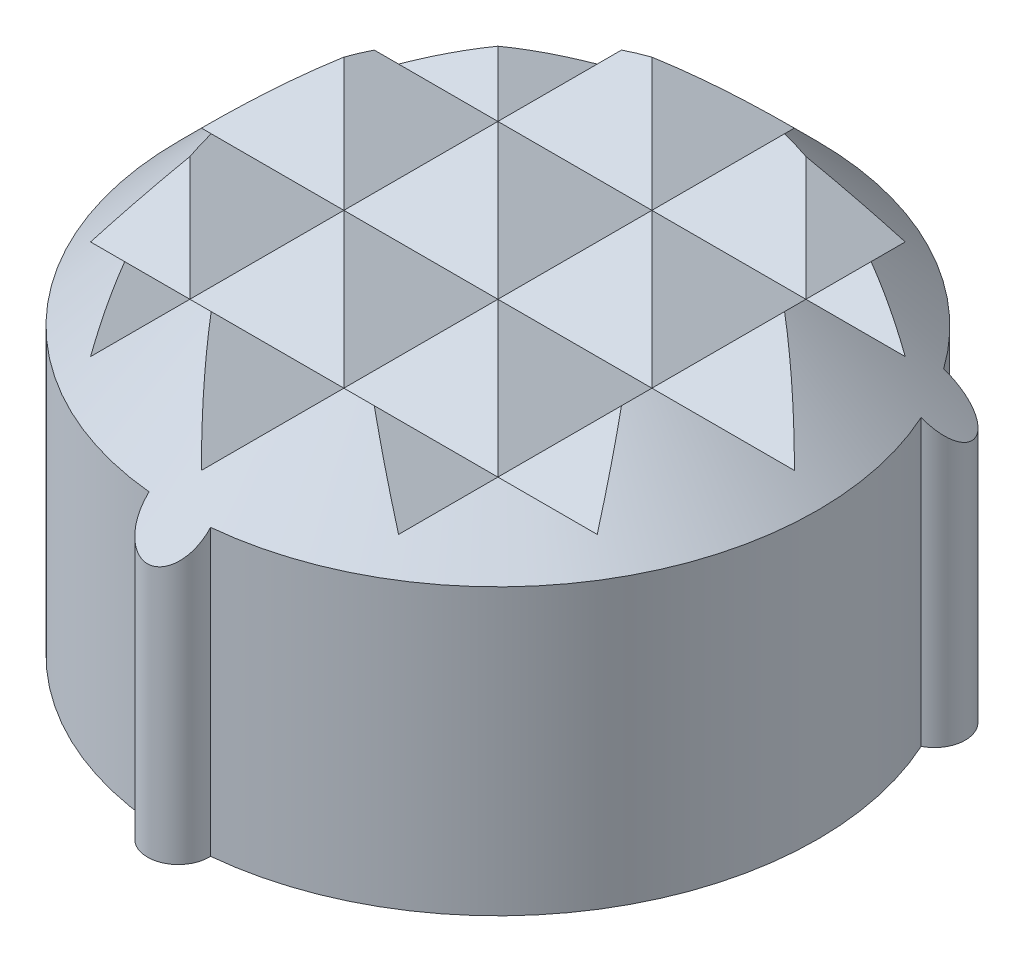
ISO-10303-21;
HEADER;
FILE_DESCRIPTION(('STEP AP214'),'2;1');
FILE_NAME('part.step','',(''),(''),'','','');
FILE_SCHEMA(('AUTOMOTIVE_DESIGN { 1 0 10303 214 1 1 1 1 }'));
ENDSEC;
DATA;
#1=APPLICATION_CONTEXT('core data for automotive mechanical design processes');
#2=APPLICATION_PROTOCOL_DEFINITION('international standard','automotive_design',2000,#1);
#3=PRODUCT_CONTEXT('',#1,'mechanical');
#4=PRODUCT('Part','Part','',(#3));
#5=PRODUCT_RELATED_PRODUCT_CATEGORY('part','',(#4));
#6=PRODUCT_DEFINITION_FORMATION('','',#4);
#7=PRODUCT_DEFINITION_CONTEXT('part definition',#1,'design');
#8=PRODUCT_DEFINITION('design','',#6,#7);
#9=PRODUCT_DEFINITION_SHAPE('','',#8);
#10=(LENGTH_UNIT() NAMED_UNIT(*) SI_UNIT(.MILLI.,.METRE.));
#11=(NAMED_UNIT(*) PLANE_ANGLE_UNIT() SI_UNIT($,.RADIAN.));
#12=(NAMED_UNIT(*) SI_UNIT($,.STERADIAN.) SOLID_ANGLE_UNIT());
#13=UNCERTAINTY_MEASURE_WITH_UNIT(LENGTH_MEASURE(1.E-05),#10,'distance_accuracy_value','');
#14=(GEOMETRIC_REPRESENTATION_CONTEXT(3) GLOBAL_UNCERTAINTY_ASSIGNED_CONTEXT((#13)) GLOBAL_UNIT_ASSIGNED_CONTEXT((#10,
#11,#12)) REPRESENTATION_CONTEXT('',''));
#15=CARTESIAN_POINT('',(0.,0.,0.));
#16=DIRECTION('',(0.,0.,1.));
#17=DIRECTION('',(1.,0.,0.));
#18=AXIS2_PLACEMENT_3D('',#15,#16,#17);
#19=CARTESIAN_POINT('',(0.,1.,0.));
#20=DIRECTION('',(0.,-1.,0.));
#21=DIRECTION('',(0.,0.,-1.));
#22=AXIS2_PLACEMENT_3D('',#19,#20,#21);
#23=CONICAL_SURFACE('',#22,6.85000000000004,0.785398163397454);
#24=CARTESIAN_POINT('',(-0.399525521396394,3.70020000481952,4.13052289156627));
#25=CARTESIAN_POINT('',(-0.400256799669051,3.68508506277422,4.14563690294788));
#26=CARTESIAN_POINT('',(-0.400141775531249,3.67000027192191,4.16080392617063));
#27=CARTESIAN_POINT('',(-0.398167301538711,3.63994728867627,4.1911828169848));
#28=CARTESIAN_POINT('',(-0.396305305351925,3.62497929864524,4.20639471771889));
#29=CARTESIAN_POINT('',(-0.387975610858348,3.58015570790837,4.25219017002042));
#30=CARTESIAN_POINT('',(-0.378750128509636,3.55063355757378,4.28268027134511));
#31=CARTESIAN_POINT('',(-0.356224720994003,3.50200402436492,4.33339265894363));
#32=CARTESIAN_POINT('',(-0.344905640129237,3.48237596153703,4.35400984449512));
#33=CARTESIAN_POINT('',(-0.318010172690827,3.44472201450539,4.39381003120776));
#34=CARTESIAN_POINT('',(-0.302448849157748,3.42669075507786,4.41299780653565));
#35=CARTESIAN_POINT('',(-0.27106394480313,3.39698225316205,4.44478324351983));
#36=CARTESIAN_POINT('',(-0.256190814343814,3.38481603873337,4.45786028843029));
#37=CARTESIAN_POINT('',(-0.223779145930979,3.36228644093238,4.48216224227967));
#38=CARTESIAN_POINT('',(-0.206243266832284,3.35192128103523,4.49338897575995));
#39=CARTESIAN_POINT('',(-0.172248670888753,3.33531633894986,4.51142324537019));
#40=CARTESIAN_POINT('',(-0.156222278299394,3.32866679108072,4.51866524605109));
#41=CARTESIAN_POINT('',(-0.122759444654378,3.31725464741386,4.53111418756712));
#42=CARTESIAN_POINT('',(-0.105323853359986,3.3124909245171,4.53632234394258));
#43=CARTESIAN_POINT('',(-0.0693422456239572,3.30512985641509,4.54437719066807));
#44=CARTESIAN_POINT('',(-0.0507898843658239,3.30254645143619,4.5472086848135));
#45=CARTESIAN_POINT('',(-0.0132949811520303,3.29979875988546,4.55022039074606));
#46=CARTESIAN_POINT('',(0.00564737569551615,3.29963335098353,4.55040183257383));
#47=CARTESIAN_POINT('',(0.0412428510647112,3.30161903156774,4.54822516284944));
#48=CARTESIAN_POINT('',(0.0579271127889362,3.30352819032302,4.54613227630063));
#49=CARTESIAN_POINT('',(0.0906003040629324,3.30916657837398,4.53995907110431));
#50=CARTESIAN_POINT('',(0.106589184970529,3.31289593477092,4.53587861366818));
#51=CARTESIAN_POINT('',(0.137922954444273,3.32208804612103,4.52583918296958));
#52=CARTESIAN_POINT('',(0.153240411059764,3.32759322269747,4.51983426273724));
#53=CARTESIAN_POINT('',(0.182543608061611,3.3400439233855,4.50628493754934));
#54=CARTESIAN_POINT('',(0.196528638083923,3.34699020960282,4.49873971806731));
#55=CARTESIAN_POINT('',(0.229168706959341,3.36555239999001,4.4786325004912));
#56=CARTESIAN_POINT('',(0.247004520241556,3.37784476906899,4.46536128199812));
#57=CARTESIAN_POINT('',(0.279520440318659,3.4042930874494,4.43694385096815));
#58=CARTESIAN_POINT('',(0.294194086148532,3.41845275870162,4.42179389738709));
#59=CARTESIAN_POINT('',(0.3250530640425,3.45326284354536,4.38474706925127));
#60=CARTESIAN_POINT('',(0.33999680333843,3.47446085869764,4.36233290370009));
#61=CARTESIAN_POINT('',(0.364772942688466,3.51842025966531,4.31621644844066));
#62=CARTESIAN_POINT('',(0.374593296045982,3.54118518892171,4.29251126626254));
#63=CARTESIAN_POINT('',(0.389130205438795,3.5865502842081,4.24566450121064));
#64=CARTESIAN_POINT('',(0.394063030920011,3.60910880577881,4.2225480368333));
#65=CARTESIAN_POINT('',(0.399793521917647,3.65450369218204,4.17640583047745));
#66=CARTESIAN_POINT('',(0.400621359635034,3.6773367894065,4.15338067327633));
#67=CARTESIAN_POINT('',(0.399525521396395,3.70020000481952,4.13052289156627));
#68=B_SPLINE_CURVE_WITH_KNOTS('',3,(#24,#25,#26,#27,#28,#29,#30,#31,#32,#33,#34,#35,#36,#37,#38,
#39,#40,#41,#42,#43,#44,#45,#46,#47,#48,#49,#50,#51,#52,#53,#54,#55,#56,#57,#58,#59,#60,#61,#62,
#63,#64,#65,#66,#67),.UNSPECIFIED.,.F.,.F.,(4,2,2,2,2,2,2,2,2,2,2,2,2,2,2,2,2,2,2,2,2,4),(0.,
0.0641179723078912,0.128329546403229,0.257815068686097,0.349429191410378,0.440722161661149,
0.510209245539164,0.579627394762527,0.635807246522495,0.691953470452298,0.748456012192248,
0.804932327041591,0.855465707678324,0.906002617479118,0.957849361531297,1.00972359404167,
1.08551176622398,1.16145335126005,1.26374061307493,1.36626731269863,1.46402219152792,
1.56105748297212),.UNSPECIFIED.);
#69=CARTESIAN_POINT('',(-0.399535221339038,3.70000000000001,4.13072289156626));
#70=VERTEX_POINT('',#69);
#71=CARTESIAN_POINT('',(0.399535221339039,3.70000000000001,4.13072289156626));
#72=VERTEX_POINT('',#71);
#73=EDGE_CURVE('E528',#70,#72,#68,.T.);
#74=ORIENTED_EDGE('',*,*,#73,.T.);
#75=CARTESIAN_POINT('',(0.,3.70000000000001,0.));
#76=DIRECTION('',(0.,-1.,0.));
#77=DIRECTION('',(0.,0.,-1.));
#78=AXIS2_PLACEMENT_3D('',#75,#76,#77);
#79=CIRCLE('',#78,4.15);
#80=CARTESIAN_POINT('',(3.77707857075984,3.70000000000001,-1.71935379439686));
#81=VERTEX_POINT('',#80);
#82=EDGE_CURVE('E624',#72,#81,#79,.F.);
#83=ORIENTED_EDGE('',*,*,#82,.T.);
#84=CARTESIAN_POINT('',(3.7541987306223,3.72532953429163,-1.70847837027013));
#85=CARTESIAN_POINT('',(3.76179946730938,3.71703428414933,-1.71180199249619));
#86=CARTESIAN_POINT('',(3.76929961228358,3.70873382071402,-1.71536103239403));
#87=CARTESIAN_POINT('',(3.80372594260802,3.67008235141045,-1.73302984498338));
#88=CARTESIAN_POINT('',(3.82928682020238,3.63977586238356,-1.75003428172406));
#89=CARTESIAN_POINT('',(3.87654084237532,3.58008618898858,-1.79015775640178));
#90=CARTESIAN_POINT('',(3.89822934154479,3.55070414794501,-1.8132840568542));
#91=CARTESIAN_POINT('',(3.9308156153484,3.50219860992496,-1.85800568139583));
#92=CARTESIAN_POINT('',(3.94301908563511,3.48256968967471,-1.8781026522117));
#93=CARTESIAN_POINT('',(3.96407307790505,3.44488630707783,-1.92129490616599));
#94=CARTESIAN_POINT('',(3.97293032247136,3.42682874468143,-1.94438405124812));
#95=CARTESIAN_POINT('',(3.98479140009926,3.39708596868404,-1.98748271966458));
#96=CARTESIAN_POINT('',(3.9886889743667,3.3849102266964,-2.00690589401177));
#97=CARTESIAN_POINT('',(3.99354558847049,3.36236432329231,-2.04713213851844));
#98=CARTESIAN_POINT('',(3.99450815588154,3.35199200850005,-2.06793352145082));
#99=CARTESIAN_POINT('',(3.99314295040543,3.33537372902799,-2.10639513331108));
#100=CARTESIAN_POINT('',(3.99140766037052,3.32871807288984,-2.12389787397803));
#101=CARTESIAN_POINT('',(3.98546903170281,3.31729357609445,-2.15910846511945));
#102=CARTESIAN_POINT('',(3.98126714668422,3.31252362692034,-2.17681618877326));
#103=CARTESIAN_POINT('',(3.97026201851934,3.30515038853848,-2.21201386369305));
#104=CARTESIAN_POINT('',(3.96344244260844,3.30256103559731,-2.22950172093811));
#105=CARTESIAN_POINT('',(3.94731045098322,3.29980223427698,-2.26349090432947));
#106=CARTESIAN_POINT('',(3.9379991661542,3.29963168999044,-2.27999267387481));
#107=CARTESIAN_POINT('',(3.91832133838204,3.30160870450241,-2.30974132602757));
#108=CARTESIAN_POINT('',(3.90816936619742,3.30351390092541,-2.32314795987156));
#109=CARTESIAN_POINT('',(3.88649101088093,3.30914496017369,-2.34836556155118));
#110=CARTESIAN_POINT('',(3.8749645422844,3.3128709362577,-2.3601764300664));
#111=CARTESIAN_POINT('',(3.85060778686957,3.32205617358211,-2.38229959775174));
#112=CARTESIAN_POINT('',(3.83775156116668,3.32755761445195,-2.39256545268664));
#113=CARTESIAN_POINT('',(3.8113714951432,3.34000095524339,-2.41117420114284));
#114=CARTESIAN_POINT('',(3.79784732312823,3.34694357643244,-2.41951612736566));
#115=CARTESIAN_POINT('',(3.76412544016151,3.36549401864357,-2.4377347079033));
#116=CARTESIAN_POINT('',(3.74372305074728,3.37777774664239,-2.44654853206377));
#117=CARTESIAN_POINT('',(3.70286544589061,3.40421218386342,-2.46050999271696));
#118=CARTESIAN_POINT('',(3.68241021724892,3.41836713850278,-2.46564911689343));
#119=CARTESIAN_POINT('',(3.63487933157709,3.45318253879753,-2.47386849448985));
#120=CARTESIAN_POINT('',(3.60797669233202,3.47439279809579,-2.47561010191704));
#121=CARTESIAN_POINT('',(3.55566189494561,3.51833772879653,-2.47401855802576));
#122=CARTESIAN_POINT('',(3.53025048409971,3.54107315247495,-2.47068288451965));
#123=CARTESIAN_POINT('',(3.48249893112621,3.58634581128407,-2.45988417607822));
#124=CARTESIAN_POINT('',(3.46006982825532,3.60883989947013,-2.45262756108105));
#125=CARTESIAN_POINT('',(3.41717061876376,3.65428384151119,-2.4345438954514));
#126=CARTESIAN_POINT('',(3.39670249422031,3.67723412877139,-2.42371328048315));
#127=CARTESIAN_POINT('',(3.35114130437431,3.73137215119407,-2.3943584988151));
#128=CARTESIAN_POINT('',(3.32697078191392,3.76260413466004,-2.37446808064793));
#129=CARTESIAN_POINT('',(3.28350078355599,3.82432132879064,-2.32910971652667));
#130=CARTESIAN_POINT('',(3.26418826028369,3.85480833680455,-2.30365706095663));
#131=CARTESIAN_POINT('',(3.24343308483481,3.89237167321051,-2.26781245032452));
#132=CARTESIAN_POINT('',(3.23920419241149,3.9003585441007,-2.25991937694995));
#133=CARTESIAN_POINT('',(3.23521264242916,3.90825862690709,-2.25182686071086));
#134=B_SPLINE_CURVE_WITH_KNOTS('',3,(#84,#85,#86,#87,#88,#89,#90,#91,#92,#93,#94,#95,#96,#97,
#98,#99,#100,#101,#102,#103,#104,#105,#106,#107,#108,#109,#110,#111,#112,#113,#114,#115,#116,
#117,#118,#119,#120,#121,#122,#123,#124,#125,#126,#127,#128,#129,#130,#131,#132,#133),
.UNSPECIFIED.,.F.,.F.,(4,2,2,2,2,2,2,2,2,2,2,2,2,2,2,2,2,2,2,2,2,2,2,2,4),(0.,
0.0352056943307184,0.164007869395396,0.292963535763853,0.384550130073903,0.475951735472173,
0.545468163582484,0.614901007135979,0.671092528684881,0.727250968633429,0.783765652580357,
0.840254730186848,0.890791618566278,0.941331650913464,0.993173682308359,1.0450417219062,
1.12079989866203,1.19673300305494,1.29908800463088,1.40149386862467,1.49896994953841,
1.59654353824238,1.72860658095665,1.86031105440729,1.89629311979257),.UNSPECIFIED.);
#135=CARTESIAN_POINT('',(3.3775433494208,3.70000000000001,-2.41136909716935));
#136=VERTEX_POINT('',#135);
#137=EDGE_CURVE('E498',#81,#136,#134,.T.);
#138=ORIENTED_EDGE('',*,*,#137,.T.);
#139=CARTESIAN_POINT('',(0.,3.70000000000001,0.));
#140=DIRECTION('',(0.,-1.,0.));
#141=DIRECTION('',(0.,0.,-1.));
#142=AXIS2_PLACEMENT_3D('',#139,#140,#141);
#143=CIRCLE('',#142,4.15);
#144=CARTESIAN_POINT('',(-3.37754334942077,3.70000000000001,-2.41136909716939));
#145=VERTEX_POINT('',#144);
#146=EDGE_CURVE('E577',#136,#145,#143,.F.);
#147=ORIENTED_EDGE('',*,*,#146,.T.);
#148=CARTESIAN_POINT('',(-3.23521264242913,3.90825862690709,-2.25182686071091));
#149=CARTESIAN_POINT('',(-3.24244337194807,3.89395253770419,-2.26647804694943));
#150=CARTESIAN_POINT('',(-3.25043730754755,3.87938478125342,-2.28045493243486));
#151=CARTESIAN_POINT('',(-3.26781518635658,3.84985896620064,-2.30706505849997));
#152=CARTESIAN_POINT('',(-3.27719889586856,3.83490097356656,-2.31969852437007));
#153=CARTESIAN_POINT('',(-3.30699582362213,3.78999302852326,-2.35531333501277));
#154=CARTESIAN_POINT('',(-3.32923376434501,3.75966224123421,-2.37635716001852));
#155=CARTESIAN_POINT('',(-3.36121814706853,3.71964291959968,-2.4004291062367));
#156=CARTESIAN_POINT('',(-3.36917968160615,3.70993831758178,-2.40597944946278));
#157=CARTESIAN_POINT('',(-3.40287813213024,3.66989517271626,-2.42769551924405));
#158=CARTESIAN_POINT('',(-3.43039048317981,3.63959080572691,-2.44131856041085));
#159=CARTESIAN_POINT('',(-3.48877146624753,3.57991150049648,-2.46215358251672));
#160=CARTESIAN_POINT('',(-3.51964418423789,3.55053775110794,-2.46935765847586));
#161=CARTESIAN_POINT('',(-3.57466207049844,3.50205095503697,-2.47519121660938));
#162=CARTESIAN_POINT('',(-3.59816245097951,3.4824322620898,-2.475701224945));
#163=CARTESIAN_POINT('',(-3.64608138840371,3.44476985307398,-2.47231998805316));
#164=CARTESIAN_POINT('',(-3.6704979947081,3.42672303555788,-2.46843763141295));
#165=CARTESIAN_POINT('',(-3.71373985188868,3.39699771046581,-2.4571472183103));
#166=CARTESIAN_POINT('',(-3.73250455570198,3.38482883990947,-2.45080549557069));
#167=CARTESIAN_POINT('',(-3.76975863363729,3.36229689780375,-2.43488837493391));
#168=CARTESIAN_POINT('',(-3.78824831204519,3.35193166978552,-2.42531687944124));
#169=CARTESIAN_POINT('',(-3.82086374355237,3.33532548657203,-2.40489645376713));
#170=CARTESIAN_POINT('',(-3.83514946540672,3.32867499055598,-2.39463889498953));
#171=CARTESIAN_POINT('',(-3.86266381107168,3.31726086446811,-2.37188481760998));
#172=CARTESIAN_POINT('',(-3.87589305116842,3.31249612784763,-2.35938961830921));
#173=CARTESIAN_POINT('',(-3.90086161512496,3.30513313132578,-2.33225669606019));
#174=CARTESIAN_POINT('',(-3.91259096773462,3.30254878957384,-2.31760589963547));
#175=CARTESIAN_POINT('',(-3.93394884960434,3.29979931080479,-2.28664029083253));
#176=CARTESIAN_POINT('',(-3.94357832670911,3.29963308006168,-2.27032623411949));
#177=CARTESIAN_POINT('',(-3.95949291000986,3.30161739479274,-2.23841102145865));
#178=CARTESIAN_POINT('',(-3.9660233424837,3.30352593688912,-2.22291555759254));
#179=CARTESIAN_POINT('',(-3.97701527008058,3.30916317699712,-2.1915330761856));
#180=CARTESIAN_POINT('',(-3.98147664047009,3.31289198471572,-2.17564603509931));
#181=CARTESIAN_POINT('',(-3.98845044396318,3.32208299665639,-2.14349057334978));
#182=CARTESIAN_POINT('',(-3.99090940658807,3.32758759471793,-2.12722293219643));
#183=CARTESIAN_POINT('',(-3.99382821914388,3.34003713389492,-2.09507124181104));
#184=CARTESIAN_POINT('',(-3.99428702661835,3.34698282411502,-2.07918739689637));
#185=CARTESIAN_POINT('',(-3.99319534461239,3.36554247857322,-2.04086922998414));
#186=CARTESIAN_POINT('',(-3.99062142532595,3.37783267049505,-2.01878958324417));
#187=CARTESIAN_POINT('',(-3.98227186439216,3.40427855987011,-1.97642163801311));
#188=CARTESIAN_POINT('',(-3.97648922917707,3.41843828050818,-1.95613736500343));
#189=CARTESIAN_POINT('',(-3.95983148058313,3.45325906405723,-1.91087268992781));
#190=CARTESIAN_POINT('',(-3.94788490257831,3.47446910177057,-1.88671086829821));
#191=CARTESIAN_POINT('',(-3.9203343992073,3.51842761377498,-1.84219951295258));
#192=CARTESIAN_POINT('',(-3.90472628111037,3.5411778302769,-1.82185439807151));
#193=CARTESIAN_POINT('',(-3.87145014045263,3.58650651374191,-1.78587013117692));
#194=CARTESIAN_POINT('',(-3.85391290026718,3.6090430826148,-1.77005514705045));
#195=CARTESIAN_POINT('',(-3.81676203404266,3.65452133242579,-1.74195160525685));
#196=CARTESIAN_POINT('',(-3.79715194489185,3.67746226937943,-1.72965716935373));
#197=CARTESIAN_POINT('',(-3.76930061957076,3.70873301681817,-1.71536106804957));
#198=CARTESIAN_POINT('',(-3.76180058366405,3.71703348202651,-1.71180187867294));
#199=CARTESIAN_POINT('',(-3.75419873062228,3.72532953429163,-1.70847837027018));
#200=B_SPLINE_CURVE_WITH_KNOTS('',3,(#148,#149,#150,#151,#152,#153,#154,#155,#156,#157,#158,
#159,#160,#161,#162,#163,#164,#165,#166,#167,#168,#169,#170,#171,#172,#173,#174,#175,#176,#177,
#178,#179,#180,#181,#182,#183,#184,#185,#186,#187,#188,#189,#190,#191,#192,#193,#194,#195,#196,
#197,#198,#199),.UNSPECIFIED.,.F.,.F.,(4,2,2,2,2,2,2,2,2,2,2,2,2,2,2,2,2,2,2,2,2,2,2,2,2,4),(0.,
0.0650741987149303,0.130137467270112,0.25871481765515,0.299886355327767,0.428665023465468,
0.557602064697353,0.649154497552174,0.740521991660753,0.81001993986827,0.879434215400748,
0.935615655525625,0.991764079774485,1.04826826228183,1.10474688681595,1.15528103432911,
1.2058182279,1.25766434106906,1.3095374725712,1.38531639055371,1.4612611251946,1.56360499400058,
1.66606663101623,1.76372743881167,1.86122421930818,1.8964299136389),.UNSPECIFIED.);
#201=CARTESIAN_POINT('',(-3.77707857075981,3.70000000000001,-1.71935379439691));
#202=VERTEX_POINT('',#201);
#203=EDGE_CURVE('E492',#145,#202,#200,.T.);
#204=ORIENTED_EDGE('',*,*,#203,.T.);
#205=CARTESIAN_POINT('',(0.,3.70000000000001,0.));
#206=DIRECTION('',(0.,-1.,0.));
#207=DIRECTION('',(0.,0.,-1.));
#208=AXIS2_PLACEMENT_3D('',#205,#206,#207);
#209=CIRCLE('',#208,4.15);
#210=EDGE_CURVE('E536',#202,#70,#209,.F.);
#211=ORIENTED_EDGE('',*,*,#210,.T.);
#212=EDGE_LOOP('',(#74,#83,#138,#147,#204,#211));
#213=FACE_BOUND('',#212,.T.);
#214=CARTESIAN_POINT('',(0.9998,5.0002,2.66866258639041));
#215=CARTESIAN_POINT('',(1.08160410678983,4.91839589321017,2.72535450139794));
#216=CARTESIAN_POINT('',(1.16389757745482,4.83610242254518,2.78061356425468));
#217=CARTESIAN_POINT('',(1.32928688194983,4.67071311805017,2.88856318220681));
#218=CARTESIAN_POINT('',(1.41238240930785,4.58761759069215,2.94125467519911));
#219=CARTESIAN_POINT('',(1.57924872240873,4.42075127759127,3.044400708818));
#220=CARTESIAN_POINT('',(1.66301941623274,4.33698058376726,3.0948555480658));
#221=CARTESIAN_POINT('',(1.8311786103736,4.1688213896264,3.19379020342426));
#222=CARTESIAN_POINT('',(1.91556732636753,4.08443267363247,3.24226928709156));
#223=CARTESIAN_POINT('',(2.00020000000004,3.99979999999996,3.28986929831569));
#224=B_SPLINE_CURVE_WITH_KNOTS('',3,(#214,#215,#216,#217,#218,#219,#220,#221,#222,#223),
.UNSPECIFIED.,.F.,.F.,(4,2,2,2,4),(0.,0.386474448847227,0.772806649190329,1.15908711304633,
1.5455094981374),.UNSPECIFIED.);
#225=CARTESIAN_POINT('',(1.19758127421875,4.80241872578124,2.80241872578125));
#226=VERTEX_POINT('',#225);
#227=CARTESIAN_POINT('',(2.,4.,3.2897568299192));
#228=VERTEX_POINT('',#227);
#229=EDGE_CURVE('E1240',#226,#228,#224,.T.);
#230=ORIENTED_EDGE('',*,*,#229,.F.);
#231=CARTESIAN_POINT('',(3.290112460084,3.9998,1.99980000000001));
#232=CARTESIAN_POINT('',(3.14157515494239,4.08330335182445,2.08330335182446));
#233=CARTESIAN_POINT('',(2.98903167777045,4.1634721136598,2.16347211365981));
#234=CARTESIAN_POINT('',(2.67495840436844,4.31555429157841,2.31555429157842));
#235=CARTESIAN_POINT('',(2.51339150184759,4.38742922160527,2.38742922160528));
#236=CARTESIAN_POINT('',(2.17948173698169,4.52141455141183,2.52141455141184));
#237=CARTESIAN_POINT('',(2.00702683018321,4.58338716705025,2.58338716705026));
#238=CARTESIAN_POINT('',(1.65392869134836,4.69385236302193,2.69385236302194));
#239=CARTESIAN_POINT('',(1.47330182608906,4.74237061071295,2.74237061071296));
#240=CARTESIAN_POINT('',(1.17366740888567,4.80840830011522,2.80840830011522));
#241=CARTESIAN_POINT('',(1.05676150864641,4.83074316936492,2.83074316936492));
#242=CARTESIAN_POINT('',(0.82073578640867,4.86861597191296,2.86861597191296));
#243=CARTESIAN_POINT('',(0.701615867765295,4.88415360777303,2.88415360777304));
#244=CARTESIAN_POINT('',(0.46280936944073,4.90790257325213,2.90790257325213));
#245=CARTESIAN_POINT('',(0.343133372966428,4.9161668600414,2.91616686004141));
#246=CARTESIAN_POINT('',(0.103218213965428,4.92531904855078,2.92531904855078));
#247=CARTESIAN_POINT('',(-0.0170209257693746,4.92620724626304,2.92620724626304));
#248=CARTESIAN_POINT('',(-0.257211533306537,4.9205789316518,2.9205789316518));
#249=CARTESIAN_POINT('',(-0.377162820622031,4.91405859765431,2.91405859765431));
#250=CARTESIAN_POINT('',(-0.615836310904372,4.89380262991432,2.89380262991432));
#251=CARTESIAN_POINT('',(-0.734558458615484,4.88006667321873,2.88006667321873));
#252=CARTESIAN_POINT('',(-0.97084979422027,4.84564202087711,2.8456420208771));
#253=CARTESIAN_POINT('',(-1.08840450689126,4.82490393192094,2.82490393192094));
#254=CARTESIAN_POINT('',(-1.32085572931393,4.77703902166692,2.77703902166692));
#255=CARTESIAN_POINT('',(-1.43575228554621,4.74991231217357,2.74991231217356));
#256=CARTESIAN_POINT('',(-1.7082327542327,4.67775629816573,2.67775629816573));
#257=CARTESIAN_POINT('',(-1.86433470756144,4.6299198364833,2.6299198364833));
#258=CARTESIAN_POINT('',(-2.17003665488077,4.52451810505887,2.52451810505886));
#259=CARTESIAN_POINT('',(-2.3196261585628,4.46693781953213,2.46693781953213));
#260=CARTESIAN_POINT('',(-2.60989693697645,4.34459233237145,2.34459233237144));
#261=CARTESIAN_POINT('',(-2.7506738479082,4.27993945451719,2.27993945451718));
#262=CARTESIAN_POINT('',(-3.02535203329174,4.14431378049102,2.14431378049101));
#263=CARTESIAN_POINT('',(-3.15927391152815,4.07336191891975,2.07336191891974));
#264=CARTESIAN_POINT('',(-3.29011246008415,3.99979999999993,1.99979999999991));
#265=B_SPLINE_CURVE_WITH_KNOTS('',3,(#231,#232,#233,#234,#235,#236,#237,#238,#239,#240,#241,
#242,#243,#244,#245,#246,#247,#248,#249,#250,#251,#252,#253,#254,#255,#256,#257,#258,#259,#260,
#261,#262,#263,#264),.UNSPECIFIED.,.F.,.F.,(4,2,2,2,2,2,2,2,2,2,2,2,2,2,2,2,4),(0.,
0.569485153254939,1.14151481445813,1.72091681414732,2.29920574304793,2.66214754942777,
3.02510523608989,3.38539783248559,3.74567597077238,4.10614004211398,4.46662024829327,
4.82969834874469,5.19277009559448,5.70233940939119,6.2127012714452,6.71589201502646,
7.21746890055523),.UNSPECIFIED.);
#266=CARTESIAN_POINT('',(0.861557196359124,4.86155719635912,2.86155719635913));
#267=VERTEX_POINT('',#266);
#268=EDGE_CURVE('E242',#226,#267,#265,.T.);
#269=ORIENTED_EDGE('',*,*,#268,.T.);
#270=CARTESIAN_POINT('',(-0.000199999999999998,3.9998,3.85019999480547));
#271=CARTESIAN_POINT('',(0.0886371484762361,4.08863714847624,3.76132897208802));
#272=CARTESIAN_POINT('',(0.176491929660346,4.17649192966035,3.67043861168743));
#273=CARTESIAN_POINT('',(0.349538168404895,4.3495381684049,3.48421974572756));
#274=CARTESIAN_POINT('',(0.434734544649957,4.43473454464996,3.38890036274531));
#275=CARTESIAN_POINT('',(0.602183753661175,4.60218375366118,3.19300347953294));
#276=CARTESIAN_POINT('',(0.684434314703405,4.68443431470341,3.09242206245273));
#277=CARTESIAN_POINT('',(0.805053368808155,4.80505336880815,2.93705233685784));
#278=CARTESIAN_POINT('',(0.844838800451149,4.84483880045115,2.88445777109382));
#279=CARTESIAN_POINT('',(0.923347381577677,4.92334738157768,2.77769136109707));
#280=CARTESIAN_POINT('',(0.96207037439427,4.96207037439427,2.72351928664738));
#281=CARTESIAN_POINT('',(1.0002,5.0002,2.6685126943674));
#282=B_SPLINE_CURVE_WITH_KNOTS('',3,(#270,#271,#272,#273,#274,#275,#276,#277,#278,#279,#280,
#281),.UNSPECIFIED.,.F.,.F.,(4,2,2,2,2,4),(0.,0.461695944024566,0.922479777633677,
1.38361162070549,1.61464179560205,1.84570585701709),.UNSPECIFIED.);
#283=CARTESIAN_POINT('',(0.,4.,3.85));
#284=VERTEX_POINT('',#283);
#285=EDGE_CURVE('E458',#284,#267,#282,.T.);
#286=ORIENTED_EDGE('',*,*,#285,.F.);
#287=CARTESIAN_POINT('',(-1.0002,5.0002,2.6685126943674));
#288=CARTESIAN_POINT('',(-0.96207037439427,4.96207037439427,2.72351928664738));
#289=CARTESIAN_POINT('',(-0.923347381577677,4.92334738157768,2.77769136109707));
#290=CARTESIAN_POINT('',(-0.844838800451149,4.84483880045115,2.88445777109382));
#291=CARTESIAN_POINT('',(-0.805053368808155,4.80505336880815,2.93705233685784));
#292=CARTESIAN_POINT('',(-0.684434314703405,4.68443431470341,3.09242206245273));
#293=CARTESIAN_POINT('',(-0.602183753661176,4.60218375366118,3.19300347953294));
#294=CARTESIAN_POINT('',(-0.434734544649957,4.43473454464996,3.38890036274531));
#295=CARTESIAN_POINT('',(-0.349538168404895,4.3495381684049,3.48421974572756));
#296=CARTESIAN_POINT('',(-0.176491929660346,4.17649192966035,3.67043861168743));
#297=CARTESIAN_POINT('',(-0.0886371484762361,4.08863714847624,3.76132897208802));
#298=CARTESIAN_POINT('',(0.00019999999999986,3.9998,3.85019999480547));
#299=B_SPLINE_CURVE_WITH_KNOTS('',3,(#287,#288,#289,#290,#291,#292,#293,#294,#295,#296,#297,
#298),.UNSPECIFIED.,.F.,.F.,(4,2,2,2,2,4),(0.,0.231064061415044,0.462094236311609,
0.923226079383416,1.38400991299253,1.84570585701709),.UNSPECIFIED.);
#300=CARTESIAN_POINT('',(-0.861557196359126,4.86155719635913,2.86155719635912));
#301=VERTEX_POINT('',#300);
#302=EDGE_CURVE('E441',#301,#284,#299,.T.);
#303=ORIENTED_EDGE('',*,*,#302,.F.);
#304=CARTESIAN_POINT('',(-1.19758127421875,4.80241872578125,2.80241872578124));
#305=VERTEX_POINT('',#304);
#306=EDGE_CURVE('E1185',#301,#305,#265,.T.);
#307=ORIENTED_EDGE('',*,*,#306,.T.);
#308=CARTESIAN_POINT('',(-2.00020000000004,3.99979999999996,3.28986929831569));
#309=CARTESIAN_POINT('',(-1.91556732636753,4.08443267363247,3.24226928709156));
#310=CARTESIAN_POINT('',(-1.8311786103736,4.1688213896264,3.19379020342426));
#311=CARTESIAN_POINT('',(-1.66301941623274,4.33698058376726,3.0948555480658));
#312=CARTESIAN_POINT('',(-1.57924872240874,4.42075127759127,3.044400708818));
#313=CARTESIAN_POINT('',(-1.41238240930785,4.58761759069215,2.94125467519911));
#314=CARTESIAN_POINT('',(-1.32928688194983,4.67071311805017,2.88856318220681));
#315=CARTESIAN_POINT('',(-1.16389757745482,4.83610242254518,2.78061356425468));
#316=CARTESIAN_POINT('',(-1.08160410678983,4.91839589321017,2.72535450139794));
#317=CARTESIAN_POINT('',(-0.9998,5.0002,2.66866258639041));
#318=B_SPLINE_CURVE_WITH_KNOTS('',3,(#308,#309,#310,#311,#312,#313,#314,#315,#316,#317),
.UNSPECIFIED.,.F.,.F.,(4,2,2,2,4),(0.,0.386422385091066,0.772702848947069,1.15903504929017,
1.5455094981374),.UNSPECIFIED.);
#319=CARTESIAN_POINT('',(-2.,4.,3.2897568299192));
#320=VERTEX_POINT('',#319);
#321=EDGE_CURVE('E1283',#320,#305,#318,.T.);
#322=ORIENTED_EDGE('',*,*,#321,.F.);
#323=CARTESIAN_POINT('',(-1.9998,3.9998,-3.29011246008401));
#324=CARTESIAN_POINT('',(-2.08330335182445,4.08330335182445,-3.1415751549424));
#325=CARTESIAN_POINT('',(-2.1634721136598,4.1634721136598,-2.98903167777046));
#326=CARTESIAN_POINT('',(-2.31555429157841,4.31555429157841,-2.67495840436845));
#327=CARTESIAN_POINT('',(-2.38742922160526,4.38742922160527,-2.5133915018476));
#328=CARTESIAN_POINT('',(-2.52141455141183,4.52141455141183,-2.1794817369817));
#329=CARTESIAN_POINT('',(-2.58338716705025,4.58338716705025,-2.00702683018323));
#330=CARTESIAN_POINT('',(-2.69385236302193,4.69385236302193,-1.65392869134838));
#331=CARTESIAN_POINT('',(-2.74237061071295,4.74237061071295,-1.47330182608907));
#332=CARTESIAN_POINT('',(-2.80840830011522,4.80840830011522,-1.17366740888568));
#333=CARTESIAN_POINT('',(-2.83074316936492,4.83074316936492,-1.05676150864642));
#334=CARTESIAN_POINT('',(-2.86861597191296,4.86861597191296,-0.820735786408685));
#335=CARTESIAN_POINT('',(-2.88415360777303,4.88415360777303,-0.701615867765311));
#336=CARTESIAN_POINT('',(-2.90790257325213,4.90790257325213,-0.462809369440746));
#337=CARTESIAN_POINT('',(-2.9161668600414,4.9161668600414,-0.343133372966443));
#338=CARTESIAN_POINT('',(-2.92531904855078,4.92531904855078,-0.103218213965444));
#339=CARTESIAN_POINT('',(-2.92620724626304,4.92620724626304,0.0170209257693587));
#340=CARTESIAN_POINT('',(-2.9205789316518,4.9205789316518,0.257211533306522));
#341=CARTESIAN_POINT('',(-2.91405859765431,4.91405859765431,0.377162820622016));
#342=CARTESIAN_POINT('',(-2.89380262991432,4.89380262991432,0.615836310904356));
#343=CARTESIAN_POINT('',(-2.88006667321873,4.88006667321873,0.734558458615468));
#344=CARTESIAN_POINT('',(-2.84564202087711,4.84564202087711,0.970849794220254));
#345=CARTESIAN_POINT('',(-2.82490393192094,4.82490393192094,1.08840450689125));
#346=CARTESIAN_POINT('',(-2.77703902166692,4.77703902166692,1.32085572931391));
#347=CARTESIAN_POINT('',(-2.74991231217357,4.74991231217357,1.43575228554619));
#348=CARTESIAN_POINT('',(-2.67775629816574,4.67775629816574,1.70823275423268));
#349=CARTESIAN_POINT('',(-2.62991983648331,4.62991983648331,1.86433470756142));
#350=CARTESIAN_POINT('',(-2.52451810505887,4.52451810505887,2.17003665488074));
#351=CARTESIAN_POINT('',(-2.46693781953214,4.46693781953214,2.31962615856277));
#352=CARTESIAN_POINT('',(-2.34459233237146,4.34459233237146,2.60989693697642));
#353=CARTESIAN_POINT('',(-2.2799394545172,4.2799394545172,2.75067384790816));
#354=CARTESIAN_POINT('',(-2.14431378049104,4.14431378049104,3.0253520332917));
#355=CARTESIAN_POINT('',(-2.07336191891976,4.07336191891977,3.15927391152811));
#356=CARTESIAN_POINT('',(-1.99979999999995,3.99979999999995,3.2901124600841));
#357=B_SPLINE_CURVE_WITH_KNOTS('',3,(#323,#324,#325,#326,#327,#328,#329,#330,#331,#332,#333,
#334,#335,#336,#337,#338,#339,#340,#341,#342,#343,#344,#345,#346,#347,#348,#349,#350,#351,#352,
#353,#354,#355,#356),.UNSPECIFIED.,.F.,.F.,(4,2,2,2,2,2,2,2,2,2,2,2,2,2,2,2,4),(0.,
0.569485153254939,1.14151481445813,1.72091681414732,2.29920574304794,2.66214754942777,
3.02510523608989,3.3853978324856,3.74567597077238,4.10614004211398,4.46662024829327,
4.82969834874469,5.19277009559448,5.70233940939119,6.21270127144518,6.71589201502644,
7.21746890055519),.UNSPECIFIED.);
#358=CARTESIAN_POINT('',(-2.42314933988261,4.42314933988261,2.4231493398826));
#359=VERTEX_POINT('',#358);
#360=EDGE_CURVE('E587',#359,#320,#357,.T.);
#361=ORIENTED_EDGE('',*,*,#360,.F.);
#362=CARTESIAN_POINT('',(-3.28975682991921,4.,1.99999999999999));
#363=VERTEX_POINT('',#362);
#364=EDGE_CURVE('E243',#359,#363,#265,.T.);
#365=ORIENTED_EDGE('',*,*,#364,.T.);
#366=CARTESIAN_POINT('',(-3.28986929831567,3.9998,2.00019999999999));
#367=CARTESIAN_POINT('',(-3.24226928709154,4.08443267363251,1.91556732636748));
#368=CARTESIAN_POINT('',(-3.19379020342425,4.16882138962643,1.83117861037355));
#369=CARTESIAN_POINT('',(-3.09485554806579,4.33698058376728,1.66301941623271));
#370=CARTESIAN_POINT('',(-3.04440070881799,4.42075127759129,1.5792487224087));
#371=CARTESIAN_POINT('',(-2.94125467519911,4.58761759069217,1.41238240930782));
#372=CARTESIAN_POINT('',(-2.88856318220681,4.67071311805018,1.32928688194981));
#373=CARTESIAN_POINT('',(-2.78061356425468,4.83610242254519,1.16389757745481));
#374=CARTESIAN_POINT('',(-2.72535450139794,4.91839589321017,1.08160410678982));
#375=CARTESIAN_POINT('',(-2.66866258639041,5.0002,0.999799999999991));
#376=B_SPLINE_CURVE_WITH_KNOTS('',3,(#366,#367,#368,#369,#370,#371,#372,#373,#374,#375),
.UNSPECIFIED.,.F.,.F.,(4,2,2,2,4),(0.,0.38642238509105,0.772702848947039,1.15903504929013,
1.54550949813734),.UNSPECIFIED.);
#377=CARTESIAN_POINT('',(-2.80241872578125,4.80241872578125,1.19758127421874));
#378=VERTEX_POINT('',#377);
#379=EDGE_CURVE('E291',#363,#378,#376,.T.);
#380=ORIENTED_EDGE('',*,*,#379,.T.);
#381=CARTESIAN_POINT('',(-2.86155719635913,4.86155719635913,0.861557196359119));
#382=VERTEX_POINT('',#381);
#383=EDGE_CURVE('E1295',#382,#378,#357,.T.);
#384=ORIENTED_EDGE('',*,*,#383,.F.);
#385=CARTESIAN_POINT('',(-2.6685126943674,5.0002,1.00019999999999));
#386=CARTESIAN_POINT('',(-2.72351928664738,4.96207037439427,0.96207037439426));
#387=CARTESIAN_POINT('',(-2.77769136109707,4.92334738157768,0.923347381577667));
#388=CARTESIAN_POINT('',(-2.88445777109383,4.84483880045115,0.844838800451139));
#389=CARTESIAN_POINT('',(-2.93705233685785,4.80505336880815,0.805053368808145));
#390=CARTESIAN_POINT('',(-3.09242206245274,4.68443431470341,0.684434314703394));
#391=CARTESIAN_POINT('',(-3.19300347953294,4.60218375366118,0.602183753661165));
#392=CARTESIAN_POINT('',(-3.38890036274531,4.43473454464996,0.434734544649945));
#393=CARTESIAN_POINT('',(-3.48421974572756,4.3495381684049,0.349538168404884));
#394=CARTESIAN_POINT('',(-3.67043861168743,4.17649192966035,0.176491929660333));
#395=CARTESIAN_POINT('',(-3.76132897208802,4.08863714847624,0.0886371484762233));
#396=CARTESIAN_POINT('',(-3.85019999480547,3.9998,-0.000200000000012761));
#397=B_SPLINE_CURVE_WITH_KNOTS('',3,(#385,#386,#387,#388,#389,#390,#391,#392,#393,#394,#395,
#396),.UNSPECIFIED.,.F.,.F.,(4,2,2,2,2,4),(0.,0.231064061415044,0.462094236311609,
0.923226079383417,1.38400991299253,1.84570585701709),.UNSPECIFIED.);
#398=CARTESIAN_POINT('',(-3.85,4.,0.));
#399=VERTEX_POINT('',#398);
#400=EDGE_CURVE('E333',#382,#399,#397,.T.);
#401=ORIENTED_EDGE('',*,*,#400,.T.);
#402=CARTESIAN_POINT('',(-3.85019999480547,3.9998,0.000199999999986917));
#403=CARTESIAN_POINT('',(-3.76132897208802,4.08863714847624,-0.0886371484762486));
#404=CARTESIAN_POINT('',(-3.67043861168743,4.17649192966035,-0.176491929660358));
#405=CARTESIAN_POINT('',(-3.48421974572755,4.3495381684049,-0.349538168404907));
#406=CARTESIAN_POINT('',(-3.38890036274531,4.43473454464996,-0.434734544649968));
#407=CARTESIAN_POINT('',(-3.19300347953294,4.60218375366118,-0.602183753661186));
#408=CARTESIAN_POINT('',(-3.09242206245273,4.68443431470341,-0.684434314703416));
#409=CARTESIAN_POINT('',(-2.93705233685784,4.80505336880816,-0.805053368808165));
#410=CARTESIAN_POINT('',(-2.88445777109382,4.84483880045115,-0.844838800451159));
#411=CARTESIAN_POINT('',(-2.77769136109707,4.92334738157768,-0.923347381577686));
#412=CARTESIAN_POINT('',(-2.72351928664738,4.96207037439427,-0.962070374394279));
#413=CARTESIAN_POINT('',(-2.6685126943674,5.0002,-1.00020000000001));
#414=B_SPLINE_CURVE_WITH_KNOTS('',3,(#402,#403,#404,#405,#406,#407,#408,#409,#410,#411,#412,
#413),.UNSPECIFIED.,.F.,.F.,(4,2,2,2,2,4),(0.,0.461695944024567,0.922479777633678,
1.38361162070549,1.61464179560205,1.84570585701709),.UNSPECIFIED.);
#415=CARTESIAN_POINT('',(-2.86155719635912,4.86155719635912,-0.861557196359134));
#416=VERTEX_POINT('',#415);
#417=EDGE_CURVE('E386',#399,#416,#414,.T.);
#418=ORIENTED_EDGE('',*,*,#417,.T.);
#419=CARTESIAN_POINT('',(-2.80241872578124,4.80241872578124,-1.19758127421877));
#420=VERTEX_POINT('',#419);
#421=EDGE_CURVE('E1298',#420,#416,#357,.T.);
#422=ORIENTED_EDGE('',*,*,#421,.F.);
#423=CARTESIAN_POINT('',(-2.66866258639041,5.0002,-0.999800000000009));
#424=CARTESIAN_POINT('',(-2.72535450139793,4.91839589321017,-1.08160410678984));
#425=CARTESIAN_POINT('',(-2.78061356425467,4.83610242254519,-1.16389757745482));
#426=CARTESIAN_POINT('',(-2.8885631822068,4.67071311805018,-1.32928688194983));
#427=CARTESIAN_POINT('',(-2.9412546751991,4.58761759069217,-1.41238240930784));
#428=CARTESIAN_POINT('',(-3.04440070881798,4.42075127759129,-1.57924872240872));
#429=CARTESIAN_POINT('',(-3.09485554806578,4.33698058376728,-1.66301941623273));
#430=CARTESIAN_POINT('',(-3.19379020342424,4.16882138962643,-1.83117861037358));
#431=CARTESIAN_POINT('',(-3.24226928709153,4.08443267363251,-1.91556732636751));
#432=CARTESIAN_POINT('',(-3.28986929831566,3.9998,-2.00020000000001));
#433=B_SPLINE_CURVE_WITH_KNOTS('',3,(#423,#424,#425,#426,#427,#428,#429,#430,#431,#432),
.UNSPECIFIED.,.F.,.F.,(4,2,2,2,4),(0.,0.386474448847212,0.772806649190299,1.15908711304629,
1.54550949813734),.UNSPECIFIED.);
#434=CARTESIAN_POINT('',(-3.28975682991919,4.,-2.00000000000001));
#435=VERTEX_POINT('',#434);
#436=EDGE_CURVE('E645',#420,#435,#433,.T.);
#437=ORIENTED_EDGE('',*,*,#436,.T.);
#438=CARTESIAN_POINT('',(-3.29011246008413,3.99979999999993,-1.99979999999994));
#439=CARTESIAN_POINT('',(-3.14157515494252,4.08330335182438,-2.08330335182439));
#440=CARTESIAN_POINT('',(-2.98903167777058,4.16347211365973,-2.16347211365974));
#441=CARTESIAN_POINT('',(-2.67495840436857,4.31555429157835,-2.31555429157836));
#442=CARTESIAN_POINT('',(-2.51339150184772,4.38742922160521,-2.38742922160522));
#443=CARTESIAN_POINT('',(-2.17948173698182,4.52141455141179,-2.52141455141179));
#444=CARTESIAN_POINT('',(-2.00702683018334,4.58338716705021,-2.58338716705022));
#445=CARTESIAN_POINT('',(-1.65392869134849,4.6938523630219,-2.6938523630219));
#446=CARTESIAN_POINT('',(-1.47330182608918,4.74237061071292,-2.74237061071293));
#447=CARTESIAN_POINT('',(-1.17366740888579,4.8084083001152,-2.8084083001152));
#448=CARTESIAN_POINT('',(-1.05676150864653,4.8307431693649,-2.8307431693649));
#449=CARTESIAN_POINT('',(-0.820735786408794,4.86861597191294,-2.86861597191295));
#450=CARTESIAN_POINT('',(-0.701615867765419,4.88415360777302,-2.88415360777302));
#451=CARTESIAN_POINT('',(-0.462809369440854,4.90790257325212,-2.90790257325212));
#452=CARTESIAN_POINT('',(-0.343133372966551,4.9161668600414,-2.9161668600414));
#453=CARTESIAN_POINT('',(-0.103218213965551,4.92531904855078,-2.92531904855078));
#454=CARTESIAN_POINT('',(0.0170209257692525,4.92620724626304,-2.92620724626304));
#455=CARTESIAN_POINT('',(0.257211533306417,4.9205789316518,-2.9205789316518));
#456=CARTESIAN_POINT('',(0.377162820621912,4.91405859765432,-2.91405859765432));
#457=CARTESIAN_POINT('',(0.615836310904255,4.89380262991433,-2.89380262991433));
#458=CARTESIAN_POINT('',(0.734558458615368,4.88006667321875,-2.88006667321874));
#459=CARTESIAN_POINT('',(0.970849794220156,4.84564202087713,-2.84564202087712));
#460=CARTESIAN_POINT('',(1.08840450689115,4.82490393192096,-2.82490393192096));
#461=CARTESIAN_POINT('',(1.32085572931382,4.77703902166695,-2.77703902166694));
#462=CARTESIAN_POINT('',(1.4357522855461,4.74991231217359,-2.74991231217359));
#463=CARTESIAN_POINT('',(1.70823275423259,4.67775629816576,-2.67775629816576));
#464=CARTESIAN_POINT('',(1.86433470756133,4.62991983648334,-2.62991983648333));
#465=CARTESIAN_POINT('',(2.17003665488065,4.52451810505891,-2.5245181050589));
#466=CARTESIAN_POINT('',(2.31962615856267,4.46693781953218,-2.46693781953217));
#467=CARTESIAN_POINT('',(2.60989693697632,4.34459233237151,-2.3445923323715));
#468=CARTESIAN_POINT('',(2.75067384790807,4.27993945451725,-2.27993945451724));
#469=CARTESIAN_POINT('',(3.0253520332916,4.14431378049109,-2.14431378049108));
#470=CARTESIAN_POINT('',(3.15927391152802,4.07336191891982,-2.07336191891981));
#471=CARTESIAN_POINT('',(3.29011246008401,3.9998,-1.99979999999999));
#472=B_SPLINE_CURVE_WITH_KNOTS('',3,(#438,#439,#440,#441,#442,#443,#444,#445,#446,#447,#448,
#449,#450,#451,#452,#453,#454,#455,#456,#457,#458,#459,#460,#461,#462,#463,#464,#465,#466,#467,
#468,#469,#470,#471),.UNSPECIFIED.,.F.,.F.,(4,2,2,2,2,2,2,2,2,2,2,2,2,2,2,2,4),(0.,
0.569485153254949,1.14151481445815,1.72091681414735,2.29920574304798,2.66214754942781,
3.02510523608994,3.38539783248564,3.74567597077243,4.10614004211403,4.46662024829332,
4.82969834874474,5.19277009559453,5.70233940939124,6.21270127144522,6.71589201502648,
7.21746890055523),.UNSPECIFIED.);
#473=CARTESIAN_POINT('',(-2.4231493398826,4.4231493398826,-2.42314933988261));
#474=VERTEX_POINT('',#473);
#475=EDGE_CURVE('E686',#435,#474,#472,.T.);
#476=ORIENTED_EDGE('',*,*,#475,.T.);
#477=CARTESIAN_POINT('',(-2.,4.,-3.2897568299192));
#478=VERTEX_POINT('',#477);
#479=EDGE_CURVE('E589',#478,#474,#357,.T.);
#480=ORIENTED_EDGE('',*,*,#479,.F.);
#481=CARTESIAN_POINT('',(-0.999800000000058,5.00019999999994,-2.66866258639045));
#482=CARTESIAN_POINT('',(-1.08160410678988,4.91839589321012,-2.72535450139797));
#483=CARTESIAN_POINT('',(-1.16389757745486,4.83610242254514,-2.78061356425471));
#484=CARTESIAN_POINT('',(-1.32928688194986,4.67071311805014,-2.88856318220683));
#485=CARTESIAN_POINT('',(-1.41238240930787,4.58761759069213,-2.94125467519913));
#486=CARTESIAN_POINT('',(-1.57924872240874,4.42075127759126,-3.044400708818));
#487=CARTESIAN_POINT('',(-1.66301941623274,4.33698058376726,-3.0948555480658));
#488=CARTESIAN_POINT('',(-1.83117861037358,4.16882138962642,-3.19379020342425));
#489=CARTESIAN_POINT('',(-1.9155673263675,4.0844326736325,-3.24226928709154));
#490=CARTESIAN_POINT('',(-2.0002,3.9998,-3.28986929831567));
#491=B_SPLINE_CURVE_WITH_KNOTS('',3,(#481,#482,#483,#484,#485,#486,#487,#488,#489,#490),
.UNSPECIFIED.,.F.,.F.,(4,2,2,2,4),(0.,0.38647444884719,0.772806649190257,1.15908711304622,
1.54550949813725),.UNSPECIFIED.);
#492=CARTESIAN_POINT('',(-1.19758127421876,4.80241872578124,-2.80241872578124));
#493=VERTEX_POINT('',#492);
#494=EDGE_CURVE('E733',#493,#478,#491,.T.);
#495=ORIENTED_EDGE('',*,*,#494,.F.);
#496=CARTESIAN_POINT('',(-0.861557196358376,4.86155719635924,-2.86155719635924));
#497=VERTEX_POINT('',#496);
#498=EDGE_CURVE('E679',#493,#497,#472,.T.);
#499=ORIENTED_EDGE('',*,*,#498,.T.);
#500=CARTESIAN_POINT('',(0.000199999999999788,3.9998,-3.85019999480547));
#501=CARTESIAN_POINT('',(-0.088637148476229,4.08863714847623,-3.76132897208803));
#502=CARTESIAN_POINT('',(-0.176491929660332,4.17649192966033,-3.67043861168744));
#503=CARTESIAN_POINT('',(-0.349538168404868,4.34953816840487,-3.48421974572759));
#504=CARTESIAN_POINT('',(-0.434734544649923,4.43473454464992,-3.38890036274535));
#505=CARTESIAN_POINT('',(-0.602183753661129,4.60218375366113,-3.19300347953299));
#506=CARTESIAN_POINT('',(-0.684434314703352,4.68443431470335,-3.0924220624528));
#507=CARTESIAN_POINT('',(-0.805053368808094,4.80505336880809,-2.93705233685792));
#508=CARTESIAN_POINT('',(-0.844838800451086,4.84483880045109,-2.88445777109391));
#509=CARTESIAN_POINT('',(-0.923347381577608,4.92334738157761,-2.77769136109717));
#510=CARTESIAN_POINT('',(-0.962070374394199,4.9620703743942,-2.72351928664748));
#511=CARTESIAN_POINT('',(-1.00019999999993,5.00019999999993,-2.66851269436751));
#512=B_SPLINE_CURVE_WITH_KNOTS('',3,(#500,#501,#502,#503,#504,#505,#506,#507,#508,#509,#510,
#511),.UNSPECIFIED.,.F.,.F.,(4,2,2,2,2,4),(0.,0.46169594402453,0.922479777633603,
1.38361162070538,1.61464179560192,1.84570585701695),.UNSPECIFIED.);
#513=CARTESIAN_POINT('',(0.,4.,-3.85000000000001));
#514=VERTEX_POINT('',#513);
#515=EDGE_CURVE('E448',#514,#497,#512,.T.);
#516=ORIENTED_EDGE('',*,*,#515,.F.);
#517=CARTESIAN_POINT('',(1.00019999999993,5.00019999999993,-2.66851269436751));
#518=CARTESIAN_POINT('',(0.962070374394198,4.9620703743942,-2.72351928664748));
#519=CARTESIAN_POINT('',(0.923347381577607,4.92334738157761,-2.77769136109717));
#520=CARTESIAN_POINT('',(0.844838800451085,4.84483880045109,-2.88445777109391));
#521=CARTESIAN_POINT('',(0.805053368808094,4.80505336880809,-2.93705233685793));
#522=CARTESIAN_POINT('',(0.684434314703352,4.68443431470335,-3.0924220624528));
#523=CARTESIAN_POINT('',(0.602183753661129,4.60218375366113,-3.19300347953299));
#524=CARTESIAN_POINT('',(0.434734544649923,4.43473454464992,-3.38890036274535));
#525=CARTESIAN_POINT('',(0.349538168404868,4.34953816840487,-3.48421974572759));
#526=CARTESIAN_POINT('',(0.176491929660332,4.17649192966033,-3.67043861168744));
#527=CARTESIAN_POINT('',(0.0886371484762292,4.08863714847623,-3.76132897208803));
#528=CARTESIAN_POINT('',(-0.000199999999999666,3.9998,-3.85019999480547));
#529=B_SPLINE_CURVE_WITH_KNOTS('',3,(#517,#518,#519,#520,#521,#522,#523,#524,#525,#526,#527,
#528),.UNSPECIFIED.,.F.,.F.,(4,2,2,2,2,4),(0.,0.231064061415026,0.462094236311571,
0.923226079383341,1.38400991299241,1.84570585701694),.UNSPECIFIED.);
#530=CARTESIAN_POINT('',(0.861557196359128,4.86155719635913,-2.86155719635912));
#531=VERTEX_POINT('',#530);
#532=EDGE_CURVE('E487',#531,#514,#529,.T.);
#533=ORIENTED_EDGE('',*,*,#532,.F.);
#534=CARTESIAN_POINT('',(1.19758127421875,4.80241872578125,-2.80241872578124));
#535=VERTEX_POINT('',#534);
#536=EDGE_CURVE('E1217',#531,#535,#472,.T.);
#537=ORIENTED_EDGE('',*,*,#536,.T.);
#538=CARTESIAN_POINT('',(2.0002,3.9998,-3.28986929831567));
#539=CARTESIAN_POINT('',(1.9155673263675,4.0844326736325,-3.24226928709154));
#540=CARTESIAN_POINT('',(1.83117861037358,4.16882138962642,-3.19379020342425));
#541=CARTESIAN_POINT('',(1.66301941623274,4.33698058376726,-3.09485554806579));
#542=CARTESIAN_POINT('',(1.57924872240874,4.42075127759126,-3.044400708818));
#543=CARTESIAN_POINT('',(1.41238240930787,4.58761759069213,-2.94125467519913));
#544=CARTESIAN_POINT('',(1.32928688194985,4.67071311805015,-2.88856318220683));
#545=CARTESIAN_POINT('',(1.16389757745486,4.83610242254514,-2.78061356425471));
#546=CARTESIAN_POINT('',(1.08160410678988,4.91839589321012,-2.72535450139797));
#547=CARTESIAN_POINT('',(0.999800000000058,5.00019999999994,-2.66866258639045));
#548=B_SPLINE_CURVE_WITH_KNOTS('',3,(#538,#539,#540,#541,#542,#543,#544,#545,#546,#547),
.UNSPECIFIED.,.F.,.F.,(4,2,2,2,4),(0.,0.38642238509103,0.772702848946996,1.15903504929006,
1.54550949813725),.UNSPECIFIED.);
#549=CARTESIAN_POINT('',(2.,4.,-3.2897568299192));
#550=VERTEX_POINT('',#549);
#551=EDGE_CURVE('E436',#550,#535,#548,.T.);
#552=ORIENTED_EDGE('',*,*,#551,.F.);
#553=CARTESIAN_POINT('',(1.99979999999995,3.99979999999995,3.2901124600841));
#554=CARTESIAN_POINT('',(2.08330335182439,4.0833033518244,3.14157515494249));
#555=CARTESIAN_POINT('',(2.16347211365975,4.16347211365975,2.98903167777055));
#556=CARTESIAN_POINT('',(2.31555429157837,4.31555429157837,2.67495840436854));
#557=CARTESIAN_POINT('',(2.38742922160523,4.38742922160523,2.51339150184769));
#558=CARTESIAN_POINT('',(2.5214145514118,4.5214145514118,2.17948173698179));
#559=CARTESIAN_POINT('',(2.58338716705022,4.58338716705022,2.00702683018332));
#560=CARTESIAN_POINT('',(2.6938523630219,4.6938523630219,1.65392869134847));
#561=CARTESIAN_POINT('',(2.74237061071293,4.74237061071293,1.47330182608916));
#562=CARTESIAN_POINT('',(2.8084083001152,4.8084083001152,1.17366740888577));
#563=CARTESIAN_POINT('',(2.8307431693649,4.83074316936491,1.05676150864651));
#564=CARTESIAN_POINT('',(2.86861597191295,4.86861597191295,0.82073578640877));
#565=CARTESIAN_POINT('',(2.88415360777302,4.88415360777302,0.701615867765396));
#566=CARTESIAN_POINT('',(2.90790257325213,4.90790257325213,0.46280936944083));
#567=CARTESIAN_POINT('',(2.9161668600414,4.9161668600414,0.343133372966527));
#568=CARTESIAN_POINT('',(2.92531904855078,4.92531904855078,0.103218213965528));
#569=CARTESIAN_POINT('',(2.92620724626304,4.92620724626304,-0.0170209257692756));
#570=CARTESIAN_POINT('',(2.9205789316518,4.9205789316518,-0.25721153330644));
#571=CARTESIAN_POINT('',(2.91405859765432,4.91405859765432,-0.377162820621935));
#572=CARTESIAN_POINT('',(2.89380262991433,4.89380262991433,-0.615836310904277));
#573=CARTESIAN_POINT('',(2.88006667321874,4.88006667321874,-0.734558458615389));
#574=CARTESIAN_POINT('',(2.84564202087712,4.84564202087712,-0.970849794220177));
#575=CARTESIAN_POINT('',(2.82490393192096,4.82490393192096,-1.08840450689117));
#576=CARTESIAN_POINT('',(2.77703902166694,4.77703902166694,-1.32085572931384));
#577=CARTESIAN_POINT('',(2.74991231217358,4.74991231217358,-1.43575228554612));
#578=CARTESIAN_POINT('',(2.67775629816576,4.67775629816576,-1.70823275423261));
#579=CARTESIAN_POINT('',(2.62991983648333,4.62991983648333,-1.86433470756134));
#580=CARTESIAN_POINT('',(2.5245181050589,4.5245181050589,-2.17003665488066));
#581=CARTESIAN_POINT('',(2.46693781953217,4.46693781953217,-2.31962615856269));
#582=CARTESIAN_POINT('',(2.3445923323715,4.3445923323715,-2.60989693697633));
#583=CARTESIAN_POINT('',(2.27993945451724,4.27993945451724,-2.75067384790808));
#584=CARTESIAN_POINT('',(2.14431378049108,4.14431378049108,-3.02535203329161));
#585=CARTESIAN_POINT('',(2.07336191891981,4.07336191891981,-3.15927391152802));
#586=CARTESIAN_POINT('',(1.9998,3.9998,-3.29011246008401));
#587=B_SPLINE_CURVE_WITH_KNOTS('',3,(#553,#554,#555,#556,#557,#558,#559,#560,#561,#562,#563,
#564,#565,#566,#567,#568,#569,#570,#571,#572,#573,#574,#575,#576,#577,#578,#579,#580,#581,#582,
#583,#584,#585,#586),.UNSPECIFIED.,.F.,.F.,(4,2,2,2,2,2,2,2,2,2,2,2,2,2,2,2,4),(0.,
0.569485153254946,1.14151481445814,1.72091681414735,2.29920574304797,2.6621475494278,
3.02510523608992,3.38539783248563,3.74567597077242,4.10614004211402,4.46662024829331,
4.82969834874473,5.19277009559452,5.70233940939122,6.2127012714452,6.71589201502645,
7.21746890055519),.UNSPECIFIED.);
#588=CARTESIAN_POINT('',(2.42314933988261,4.42314933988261,-2.4231493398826));
#589=VERTEX_POINT('',#588);
#590=EDGE_CURVE('E580',#589,#550,#587,.T.);
#591=ORIENTED_EDGE('',*,*,#590,.F.);
#592=CARTESIAN_POINT('',(3.28975682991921,4.,-1.99999999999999));
#593=VERTEX_POINT('',#592);
#594=EDGE_CURVE('E687',#589,#593,#472,.T.);
#595=ORIENTED_EDGE('',*,*,#594,.T.);
#596=CARTESIAN_POINT('',(3.28986929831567,3.9998,-2.00019999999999));
#597=CARTESIAN_POINT('',(3.24226928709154,4.08443267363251,-1.91556732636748));
#598=CARTESIAN_POINT('',(3.19379020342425,4.16882138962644,-1.83117861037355));
#599=CARTESIAN_POINT('',(3.09485554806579,4.33698058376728,-1.66301941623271));
#600=CARTESIAN_POINT('',(3.04440070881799,4.42075127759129,-1.5792487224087));
#601=CARTESIAN_POINT('',(2.94125467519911,4.58761759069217,-1.41238240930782));
#602=CARTESIAN_POINT('',(2.88856318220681,4.67071311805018,-1.32928688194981));
#603=CARTESIAN_POINT('',(2.78061356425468,4.83610242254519,-1.16389757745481));
#604=CARTESIAN_POINT('',(2.72535450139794,4.91839589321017,-1.08160410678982));
#605=CARTESIAN_POINT('',(2.66866258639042,5.0002,-0.999799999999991));
#606=B_SPLINE_CURVE_WITH_KNOTS('',3,(#596,#597,#598,#599,#600,#601,#602,#603,#604,#605),
.UNSPECIFIED.,.F.,.F.,(4,2,2,2,4),(0.,0.386422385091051,0.772702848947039,1.15903504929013,
1.54550949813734),.UNSPECIFIED.);
#607=CARTESIAN_POINT('',(2.80241872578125,4.80241872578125,-1.19758127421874));
#608=VERTEX_POINT('',#607);
#609=EDGE_CURVE('E669',#593,#608,#606,.T.);
#610=ORIENTED_EDGE('',*,*,#609,.T.);
#611=CARTESIAN_POINT('',(2.86155719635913,4.86155719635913,-0.861557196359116));
#612=VERTEX_POINT('',#611);
#613=EDGE_CURVE('E588',#612,#608,#587,.T.);
#614=ORIENTED_EDGE('',*,*,#613,.F.);
#615=CARTESIAN_POINT('',(2.6685126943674,5.0002,-1.00019999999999));
#616=CARTESIAN_POINT('',(2.72351928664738,4.96207037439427,-0.96207037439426));
#617=CARTESIAN_POINT('',(2.77769136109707,4.92334738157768,-0.923347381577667));
#618=CARTESIAN_POINT('',(2.88445777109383,4.84483880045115,-0.844838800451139));
#619=CARTESIAN_POINT('',(2.93705233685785,4.80505336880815,-0.805053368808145));
#620=CARTESIAN_POINT('',(3.09242206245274,4.68443431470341,-0.684434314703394));
#621=CARTESIAN_POINT('',(3.19300347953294,4.60218375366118,-0.602183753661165));
#622=CARTESIAN_POINT('',(3.38890036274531,4.43473454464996,-0.434734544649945));
#623=CARTESIAN_POINT('',(3.48421974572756,4.3495381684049,-0.349538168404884));
#624=CARTESIAN_POINT('',(3.67043861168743,4.17649192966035,-0.176491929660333));
#625=CARTESIAN_POINT('',(3.76132897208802,4.08863714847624,-0.0886371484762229));
#626=CARTESIAN_POINT('',(3.85019999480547,3.9998,0.00020000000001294));
#627=B_SPLINE_CURVE_WITH_KNOTS('',3,(#615,#616,#617,#618,#619,#620,#621,#622,#623,#624,#625,
#626),.UNSPECIFIED.,.F.,.F.,(4,2,2,2,2,4),(0.,0.231064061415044,0.462094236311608,
0.923226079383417,1.38400991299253,1.84570585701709),.UNSPECIFIED.);
#628=CARTESIAN_POINT('',(3.85,4.,0.));
#629=VERTEX_POINT('',#628);
#630=EDGE_CURVE('E393',#612,#629,#627,.T.);
#631=ORIENTED_EDGE('',*,*,#630,.T.);
#632=CARTESIAN_POINT('',(3.85019999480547,3.9998,-0.000199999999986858));
#633=CARTESIAN_POINT('',(3.76132897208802,4.08863714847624,0.0886371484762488));
#634=CARTESIAN_POINT('',(3.67043861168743,4.17649192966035,0.176491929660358));
#635=CARTESIAN_POINT('',(3.48421974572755,4.3495381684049,0.349538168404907));
#636=CARTESIAN_POINT('',(3.38890036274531,4.43473454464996,0.434734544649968));
#637=CARTESIAN_POINT('',(3.19300347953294,4.60218375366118,0.602183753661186));
#638=CARTESIAN_POINT('',(3.09242206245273,4.68443431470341,0.684434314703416));
#639=CARTESIAN_POINT('',(2.93705233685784,4.80505336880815,0.805053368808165));
#640=CARTESIAN_POINT('',(2.88445777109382,4.84483880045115,0.844838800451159));
#641=CARTESIAN_POINT('',(2.77769136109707,4.92334738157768,0.923347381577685));
#642=CARTESIAN_POINT('',(2.72351928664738,4.96207037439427,0.962070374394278));
#643=CARTESIAN_POINT('',(2.6685126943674,5.0002,1.00020000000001));
#644=B_SPLINE_CURVE_WITH_KNOTS('',3,(#632,#633,#634,#635,#636,#637,#638,#639,#640,#641,#642,
#643),.UNSPECIFIED.,.F.,.F.,(4,2,2,2,2,4),(0.,0.461695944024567,0.922479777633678,
1.38361162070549,1.61464179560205,1.84570585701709),.UNSPECIFIED.);
#645=CARTESIAN_POINT('',(2.86155719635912,4.86155719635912,0.861557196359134));
#646=VERTEX_POINT('',#645);
#647=EDGE_CURVE('E346',#629,#646,#644,.T.);
#648=ORIENTED_EDGE('',*,*,#647,.T.);
#649=CARTESIAN_POINT('',(2.80241872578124,4.80241872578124,1.19758127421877));
#650=VERTEX_POINT('',#649);
#651=EDGE_CURVE('E258',#650,#646,#587,.T.);
#652=ORIENTED_EDGE('',*,*,#651,.F.);
#653=CARTESIAN_POINT('',(2.66866258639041,5.0002,0.999800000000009));
#654=CARTESIAN_POINT('',(2.72535450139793,4.91839589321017,1.08160410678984));
#655=CARTESIAN_POINT('',(2.78061356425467,4.83610242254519,1.16389757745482));
#656=CARTESIAN_POINT('',(2.8885631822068,4.67071311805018,1.32928688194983));
#657=CARTESIAN_POINT('',(2.9412546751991,4.58761759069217,1.41238240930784));
#658=CARTESIAN_POINT('',(3.04440070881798,4.42075127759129,1.57924872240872));
#659=CARTESIAN_POINT('',(3.09485554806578,4.33698058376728,1.66301941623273));
#660=CARTESIAN_POINT('',(3.19379020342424,4.16882138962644,1.83117861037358));
#661=CARTESIAN_POINT('',(3.24226928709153,4.08443267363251,1.91556732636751));
#662=CARTESIAN_POINT('',(3.28986929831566,3.9998,2.00020000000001));
#663=B_SPLINE_CURVE_WITH_KNOTS('',3,(#653,#654,#655,#656,#657,#658,#659,#660,#661,#662),
.UNSPECIFIED.,.F.,.F.,(4,2,2,2,4),(0.,0.386474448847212,0.7728066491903,1.15908711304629,
1.54550949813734),.UNSPECIFIED.);
#664=CARTESIAN_POINT('',(3.28975682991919,4.,2.00000000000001));
#665=VERTEX_POINT('',#664);
#666=EDGE_CURVE('E246',#650,#665,#663,.T.);
#667=ORIENTED_EDGE('',*,*,#666,.T.);
#668=CARTESIAN_POINT('',(2.4231493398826,4.4231493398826,2.42314933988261));
#669=VERTEX_POINT('',#668);
#670=EDGE_CURVE('E228',#665,#669,#265,.T.);
#671=ORIENTED_EDGE('',*,*,#670,.T.);
#672=EDGE_CURVE('E581',#228,#669,#587,.T.);
#673=ORIENTED_EDGE('',*,*,#672,.F.);
#674=EDGE_LOOP('',(#230,#269,#286,#303,#307,#322,#361,#365,#380,#384,#401,#418,#422,#437,#476,
#480,#495,#499,#516,#533,#537,#552,#591,#595,#610,#614,#631,#648,#652,#667,#671,#673));
#675=FACE_BOUND('',#674,.T.);
#676=ADVANCED_FACE('F38',(#213,#675),#23,.T.);
#677=CARTESIAN_POINT('',(1.,5.,-4.15));
#678=DIRECTION('',(0.707106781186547,-0.707106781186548,0.));
#679=DIRECTION('',(0.707106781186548,0.707106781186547,0.));
#680=AXIS2_PLACEMENT_3D('',#677,#678,#679);
#681=PLANE('',#680);
#682=DIRECTION('',(0.577350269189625,0.577350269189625,0.577350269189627));
#683=VECTOR('',#682,1.);
#684=CARTESIAN_POINT('',(-1.38333333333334,2.61666666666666,0.616666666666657));
#685=LINE('',#684,#683);
#686=CARTESIAN_POINT('',(0.,4.,2.));
#687=VERTEX_POINT('',#686);
#688=EDGE_CURVE('E1184',#687,#267,#685,.T.);
#689=ORIENTED_EDGE('',*,*,#688,.F.);
#690=DIRECTION('',(0.,0.,1.));
#691=VECTOR('',#690,1.);
#692=CARTESIAN_POINT('',(0.,4.,-4.15));
#693=LINE('',#692,#691);
#694=EDGE_CURVE('E429',#687,#284,#693,.T.);
#695=ORIENTED_EDGE('',*,*,#694,.T.);
#696=ORIENTED_EDGE('',*,*,#285,.T.);
#697=EDGE_LOOP('',(#689,#695,#696));
#698=FACE_BOUND('',#697,.T.);
#699=ADVANCED_FACE('F472',(#698),#681,.F.);
#700=DIRECTION('',(-0.577350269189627,-0.577350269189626,0.577350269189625));
#701=VECTOR('',#700,1.);
#702=CARTESIAN_POINT('',(2.71666666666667,6.71666666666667,-0.716666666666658));
#703=LINE('',#702,#701);
#704=CARTESIAN_POINT('',(1.,5.,1.));
#705=VERTEX_POINT('',#704);
#706=EDGE_CURVE('E298',#705,#687,#703,.T.);
#707=ORIENTED_EDGE('',*,*,#706,.F.);
#708=DIRECTION('',(0.577350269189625,0.577350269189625,0.577350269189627));
#709=VECTOR('',#708,1.);
#710=CARTESIAN_POINT('',(-0.716666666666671,3.28333333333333,-0.716666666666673));
#711=LINE('',#710,#709);
#712=CARTESIAN_POINT('',(0.,4.,0.));
#713=VERTEX_POINT('',#712);
#714=EDGE_CURVE('E318',#713,#705,#711,.T.);
#715=ORIENTED_EDGE('',*,*,#714,.F.);
#716=EDGE_CURVE('E321',#713,#687,#693,.T.);
#717=ORIENTED_EDGE('',*,*,#716,.T.);
#718=EDGE_LOOP('',(#707,#715,#717));
#719=FACE_BOUND('',#718,.T.);
#720=ADVANCED_FACE('F317',(#719),#681,.F.);
#721=CARTESIAN_POINT('',(0.,4.,-4.15));
#722=DIRECTION('',(-0.707106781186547,-0.707106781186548,0.));
#723=DIRECTION('',(0.707106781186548,-0.707106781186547,0.));
#724=AXIS2_PLACEMENT_3D('',#721,#722,#723);
#725=PLANE('',#724);
#726=DIRECTION('',(0.577350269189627,-0.577350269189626,-0.577350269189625));
#727=VECTOR('',#726,1.);
#728=CARTESIAN_POINT('',(2.05,1.95,-0.049999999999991));
#729=LINE('',#728,#727);
#730=EDGE_CURVE('E1286',#301,#687,#729,.T.);
#731=ORIENTED_EDGE('',*,*,#730,.F.);
#732=ORIENTED_EDGE('',*,*,#302,.T.);
#733=ORIENTED_EDGE('',*,*,#694,.F.);
#734=EDGE_LOOP('',(#731,#732,#733));
#735=FACE_BOUND('',#734,.T.);
#736=ADVANCED_FACE('F467',(#735),#725,.F.);
#737=DIRECTION('',(-0.577350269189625,0.577350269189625,-0.577350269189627));
#738=VECTOR('',#737,1.);
#739=CARTESIAN_POINT('',(-2.05,6.05,-0.050000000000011));
#740=LINE('',#739,#738);
#741=CARTESIAN_POINT('',(-1.,5.,0.999999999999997));
#742=VERTEX_POINT('',#741);
#743=EDGE_CURVE('E323',#687,#742,#740,.T.);
#744=ORIENTED_EDGE('',*,*,#743,.F.);
#745=ORIENTED_EDGE('',*,*,#716,.F.);
#746=DIRECTION('',(0.577350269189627,-0.577350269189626,-0.577350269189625));
#747=VECTOR('',#746,1.);
#748=CARTESIAN_POINT('',(1.38333333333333,2.61666666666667,-1.38333333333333));
#749=LINE('',#748,#747);
#750=EDGE_CURVE('E334',#742,#713,#749,.T.);
#751=ORIENTED_EDGE('',*,*,#750,.F.);
#752=EDGE_LOOP('',(#744,#745,#751));
#753=FACE_BOUND('',#752,.T.);
#754=ADVANCED_FACE('F426',(#753),#725,.F.);
#755=CARTESIAN_POINT('',(3.,5.,-4.15));
#756=DIRECTION('',(0.707106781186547,-0.707106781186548,0.));
#757=DIRECTION('',(0.707106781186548,0.707106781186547,0.));
#758=AXIS2_PLACEMENT_3D('',#755,#756,#757);
#759=PLANE('',#758);
#760=DIRECTION('',(0.577350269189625,0.577350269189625,0.577350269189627));
#761=VECTOR('',#760,1.);
#762=CARTESIAN_POINT('',(0.616666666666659,2.61666666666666,0.616666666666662));
#763=LINE('',#762,#761);
#764=CARTESIAN_POINT('',(2.,4.,2.00000000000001));
#765=VERTEX_POINT('',#764);
#766=EDGE_CURVE('E234',#765,#669,#763,.T.);
#767=ORIENTED_EDGE('',*,*,#766,.F.);
#768=DIRECTION('',(0.,0.,1.));
#769=VECTOR('',#768,1.);
#770=CARTESIAN_POINT('',(2.,4.,-4.15));
#771=LINE('',#770,#769);
#772=EDGE_CURVE('E1243',#765,#228,#771,.T.);
#773=ORIENTED_EDGE('',*,*,#772,.T.);
#774=ORIENTED_EDGE('',*,*,#672,.T.);
#775=EDGE_LOOP('',(#767,#773,#774));
#776=FACE_BOUND('',#775,.T.);
#777=ADVANCED_FACE('F594',(#776),#759,.F.);
#778=DIRECTION('',(-0.577350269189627,-0.577350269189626,0.577350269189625));
#779=VECTOR('',#778,1.);
#780=CARTESIAN_POINT('',(4.71666666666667,6.71666666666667,-0.716666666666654));
#781=LINE('',#780,#779);
#782=EDGE_CURVE('E248',#650,#765,#781,.T.);
#783=ORIENTED_EDGE('',*,*,#782,.F.);
#784=ORIENTED_EDGE('',*,*,#651,.T.);
#785=DIRECTION('',(0.577350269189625,0.577350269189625,0.577350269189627));
#786=VECTOR('',#785,1.);
#787=CARTESIAN_POINT('',(1.28333333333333,3.28333333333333,-0.716666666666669));
#788=LINE('',#787,#786);
#789=CARTESIAN_POINT('',(2.,4.,0.));
#790=VERTEX_POINT('',#789);
#791=EDGE_CURVE('E340',#790,#646,#788,.T.);
#792=ORIENTED_EDGE('',*,*,#791,.F.);
#793=EDGE_CURVE('E337',#790,#765,#771,.T.);
#794=ORIENTED_EDGE('',*,*,#793,.T.);
#795=EDGE_LOOP('',(#783,#784,#792,#794));
#796=FACE_BOUND('',#795,.T.);
#797=ADVANCED_FACE('F597',(#796),#759,.F.);
#798=CARTESIAN_POINT('',(2.,4.,-4.15));
#799=DIRECTION('',(-0.707106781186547,-0.707106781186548,0.));
#800=DIRECTION('',(0.707106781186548,-0.707106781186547,0.));
#801=AXIS2_PLACEMENT_3D('',#798,#799,#800);
#802=PLANE('',#801);
#803=DIRECTION('',(0.577350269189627,-0.577350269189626,-0.577350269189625));
#804=VECTOR('',#803,1.);
#805=CARTESIAN_POINT('',(4.05,1.95,-0.0499999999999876));
#806=LINE('',#805,#804);
#807=EDGE_CURVE('E1174',#226,#765,#806,.T.);
#808=ORIENTED_EDGE('',*,*,#807,.F.);
#809=ORIENTED_EDGE('',*,*,#229,.T.);
#810=ORIENTED_EDGE('',*,*,#772,.F.);
#811=EDGE_LOOP('',(#808,#809,#810));
#812=FACE_BOUND('',#811,.T.);
#813=ADVANCED_FACE('F479',(#812),#802,.F.);
#814=DIRECTION('',(-0.577350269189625,0.577350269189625,-0.577350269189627));
#815=VECTOR('',#814,1.);
#816=CARTESIAN_POINT('',(-0.0500000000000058,6.05000000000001,-0.0500000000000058));
#817=LINE('',#816,#815);
#818=EDGE_CURVE('E267',#765,#705,#817,.T.);
#819=ORIENTED_EDGE('',*,*,#818,.F.);
#820=ORIENTED_EDGE('',*,*,#793,.F.);
#821=DIRECTION('',(0.577350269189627,-0.577350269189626,-0.577350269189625));
#822=VECTOR('',#821,1.);
#823=CARTESIAN_POINT('',(3.38333333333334,2.61666666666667,-1.38333333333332));
#824=LINE('',#823,#822);
#825=EDGE_CURVE('E328',#705,#790,#824,.T.);
#826=ORIENTED_EDGE('',*,*,#825,.F.);
#827=EDGE_LOOP('',(#819,#820,#826));
#828=FACE_BOUND('',#827,.T.);
#829=ADVANCED_FACE('F336',(#828),#802,.F.);
#830=CARTESIAN_POINT('',(-1.,5.,-4.15));
#831=DIRECTION('',(0.707106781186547,-0.707106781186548,0.));
#832=DIRECTION('',(0.707106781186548,0.707106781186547,0.));
#833=AXIS2_PLACEMENT_3D('',#830,#831,#832);
#834=PLANE('',#833);
#835=DIRECTION('',(0.577350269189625,0.577350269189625,0.577350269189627));
#836=VECTOR('',#835,1.);
#837=CARTESIAN_POINT('',(-3.38333333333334,2.61666666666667,0.616666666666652));
#838=LINE('',#837,#836);
#839=CARTESIAN_POINT('',(-2.,4.,1.99999999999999));
#840=VERTEX_POINT('',#839);
#841=EDGE_CURVE('E260',#840,#305,#838,.T.);
#842=ORIENTED_EDGE('',*,*,#841,.F.);
#843=DIRECTION('',(0.,0.,1.));
#844=VECTOR('',#843,1.);
#845=CARTESIAN_POINT('',(-2.,4.,-4.15));
#846=LINE('',#845,#844);
#847=EDGE_CURVE('E361',#840,#320,#846,.T.);
#848=ORIENTED_EDGE('',*,*,#847,.T.);
#849=ORIENTED_EDGE('',*,*,#321,.T.);
#850=EDGE_LOOP('',(#842,#848,#849));
#851=FACE_BOUND('',#850,.T.);
#852=ADVANCED_FACE('F381',(#851),#834,.F.);
#853=DIRECTION('',(-0.577350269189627,-0.577350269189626,0.577350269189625));
#854=VECTOR('',#853,1.);
#855=CARTESIAN_POINT('',(0.716666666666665,6.71666666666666,-0.716666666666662));
#856=LINE('',#855,#854);
#857=EDGE_CURVE('E1266',#742,#840,#856,.T.);
#858=ORIENTED_EDGE('',*,*,#857,.F.);
#859=DIRECTION('',(0.577350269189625,0.577350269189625,0.577350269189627));
#860=VECTOR('',#859,1.);
#861=CARTESIAN_POINT('',(-2.71666666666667,3.28333333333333,-0.716666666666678));
#862=LINE('',#861,#860);
#863=CARTESIAN_POINT('',(-2.,4.,0.));
#864=VERTEX_POINT('',#863);
#865=EDGE_CURVE('E401',#864,#742,#862,.T.);
#866=ORIENTED_EDGE('',*,*,#865,.F.);
#867=EDGE_CURVE('E1271',#864,#840,#846,.T.);
#868=ORIENTED_EDGE('',*,*,#867,.T.);
#869=EDGE_LOOP('',(#858,#866,#868));
#870=FACE_BOUND('',#869,.T.);
#871=ADVANCED_FACE('F604',(#870),#834,.F.);
#872=CARTESIAN_POINT('',(-2.,4.,-4.15));
#873=DIRECTION('',(-0.707106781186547,-0.707106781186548,0.));
#874=DIRECTION('',(0.707106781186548,-0.707106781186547,0.));
#875=AXIS2_PLACEMENT_3D('',#872,#873,#874);
#876=PLANE('',#875);
#877=DIRECTION('',(0.577350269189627,-0.577350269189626,-0.577350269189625));
#878=VECTOR('',#877,1.);
#879=CARTESIAN_POINT('',(0.0499999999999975,1.95000000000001,-0.0499999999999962));
#880=LINE('',#879,#878);
#881=EDGE_CURVE('E12',#359,#840,#880,.T.);
#882=ORIENTED_EDGE('',*,*,#881,.F.);
#883=ORIENTED_EDGE('',*,*,#360,.T.);
#884=ORIENTED_EDGE('',*,*,#847,.F.);
#885=EDGE_LOOP('',(#882,#883,#884));
#886=FACE_BOUND('',#885,.T.);
#887=ADVANCED_FACE('F600',(#886),#876,.F.);
#888=DIRECTION('',(-0.577350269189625,0.577350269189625,-0.577350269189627));
#889=VECTOR('',#888,1.);
#890=CARTESIAN_POINT('',(-4.05,6.05,-0.0500000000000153));
#891=LINE('',#890,#889);
#892=EDGE_CURVE('E251',#840,#378,#891,.T.);
#893=ORIENTED_EDGE('',*,*,#892,.F.);
#894=ORIENTED_EDGE('',*,*,#867,.F.);
#895=DIRECTION('',(0.577350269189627,-0.577350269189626,-0.577350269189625));
#896=VECTOR('',#895,1.);
#897=CARTESIAN_POINT('',(-0.616666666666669,2.61666666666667,-1.38333333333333));
#898=LINE('',#897,#896);
#899=EDGE_CURVE('E1297',#382,#864,#898,.T.);
#900=ORIENTED_EDGE('',*,*,#899,.F.);
#901=ORIENTED_EDGE('',*,*,#383,.T.);
#902=EDGE_LOOP('',(#893,#894,#900,#901));
#903=FACE_BOUND('',#902,.T.);
#904=ADVANCED_FACE('F603',(#903),#876,.F.);
#905=DIRECTION('',(0.577350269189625,0.577350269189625,0.577350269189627));
#906=VECTOR('',#905,1.);
#907=CARTESIAN_POINT('',(-0.0500000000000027,3.95,-2.05));
#908=LINE('',#907,#906);
#909=CARTESIAN_POINT('',(0.,4.,-2.));
#910=VERTEX_POINT('',#909);
#911=CARTESIAN_POINT('',(1.,5.,-0.999999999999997));
#912=VERTEX_POINT('',#911);
#913=EDGE_CURVE('E644',#910,#912,#908,.T.);
#914=ORIENTED_EDGE('',*,*,#913,.F.);
#915=EDGE_CURVE('E428',#910,#713,#693,.T.);
#916=ORIENTED_EDGE('',*,*,#915,.T.);
#917=DIRECTION('',(-0.577350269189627,-0.577350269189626,0.577350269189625));
#918=VECTOR('',#917,1.);
#919=CARTESIAN_POINT('',(2.05,6.05,-2.04999999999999));
#920=LINE('',#919,#918);
#921=EDGE_CURVE('E1199',#912,#713,#920,.T.);
#922=ORIENTED_EDGE('',*,*,#921,.F.);
#923=EDGE_LOOP('',(#914,#916,#922));
#924=FACE_BOUND('',#923,.T.);
#925=ADVANCED_FACE('F610',(#924),#681,.F.);
#926=DIRECTION('',(-0.577350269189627,-0.577350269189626,0.577350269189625));
#927=VECTOR('',#926,1.);
#928=CARTESIAN_POINT('',(1.38333333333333,5.38333333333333,-3.38333333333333));
#929=LINE('',#928,#927);
#930=EDGE_CURVE('E728',#531,#910,#929,.T.);
#931=ORIENTED_EDGE('',*,*,#930,.F.);
#932=ORIENTED_EDGE('',*,*,#532,.T.);
#933=EDGE_CURVE('E431',#514,#910,#693,.T.);
#934=ORIENTED_EDGE('',*,*,#933,.T.);
#935=EDGE_LOOP('',(#931,#932,#934));
#936=FACE_BOUND('',#935,.T.);
#937=ADVANCED_FACE('F478',(#936),#681,.F.);
#938=DIRECTION('',(0.577350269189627,-0.577350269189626,-0.577350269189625));
#939=VECTOR('',#938,1.);
#940=CARTESIAN_POINT('',(0.716666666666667,3.28333333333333,-2.71666666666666));
#941=LINE('',#940,#939);
#942=CARTESIAN_POINT('',(-1.,5.,-1.));
#943=VERTEX_POINT('',#942);
#944=EDGE_CURVE('E646',#943,#910,#941,.T.);
#945=ORIENTED_EDGE('',*,*,#944,.F.);
#946=DIRECTION('',(-0.577350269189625,0.577350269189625,-0.577350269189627));
#947=VECTOR('',#946,1.);
#948=CARTESIAN_POINT('',(-1.38333333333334,5.38333333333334,-1.38333333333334));
#949=LINE('',#948,#947);
#950=EDGE_CURVE('E419',#713,#943,#949,.T.);
#951=ORIENTED_EDGE('',*,*,#950,.F.);
#952=ORIENTED_EDGE('',*,*,#915,.F.);
#953=EDGE_LOOP('',(#945,#951,#952));
#954=FACE_BOUND('',#953,.T.);
#955=ADVANCED_FACE('F736',(#954),#725,.F.);
#956=DIRECTION('',(-0.577350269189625,0.577350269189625,-0.577350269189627));
#957=VECTOR('',#956,1.);
#958=CARTESIAN_POINT('',(-0.716666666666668,4.71666666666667,-2.71666666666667));
#959=LINE('',#958,#957);
#960=EDGE_CURVE('E688',#910,#497,#959,.T.);
#961=ORIENTED_EDGE('',*,*,#960,.F.);
#962=ORIENTED_EDGE('',*,*,#933,.F.);
#963=ORIENTED_EDGE('',*,*,#515,.T.);
#964=EDGE_LOOP('',(#961,#962,#963));
#965=FACE_BOUND('',#964,.T.);
#966=ADVANCED_FACE('F471',(#965),#725,.F.);
#967=DIRECTION('',(0.577350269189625,0.577350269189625,0.577350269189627));
#968=VECTOR('',#967,1.);
#969=CARTESIAN_POINT('',(1.94999999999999,3.95,-2.05));
#970=LINE('',#969,#968);
#971=CARTESIAN_POINT('',(2.,4.,-1.99999999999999));
#972=VERTEX_POINT('',#971);
#973=EDGE_CURVE('E666',#972,#608,#970,.T.);
#974=ORIENTED_EDGE('',*,*,#973,.F.);
#975=EDGE_CURVE('E1241',#972,#790,#771,.T.);
#976=ORIENTED_EDGE('',*,*,#975,.T.);
#977=DIRECTION('',(-0.577350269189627,-0.577350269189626,0.577350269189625));
#978=VECTOR('',#977,1.);
#979=CARTESIAN_POINT('',(4.05,6.05,-2.04999999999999));
#980=LINE('',#979,#978);
#981=EDGE_CURVE('E402',#612,#790,#980,.T.);
#982=ORIENTED_EDGE('',*,*,#981,.F.);
#983=ORIENTED_EDGE('',*,*,#613,.T.);
#984=EDGE_LOOP('',(#974,#976,#982,#983));
#985=FACE_BOUND('',#984,.T.);
#986=ADVANCED_FACE('F735',(#985),#759,.F.);
#987=DIRECTION('',(-0.577350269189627,-0.577350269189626,0.577350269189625));
#988=VECTOR('',#987,1.);
#989=CARTESIAN_POINT('',(3.38333333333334,5.38333333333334,-3.38333333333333));
#990=LINE('',#989,#988);
#991=EDGE_CURVE('E1213',#589,#972,#990,.T.);
#992=ORIENTED_EDGE('',*,*,#991,.F.);
#993=ORIENTED_EDGE('',*,*,#590,.T.);
#994=EDGE_CURVE('E1238',#550,#972,#771,.T.);
#995=ORIENTED_EDGE('',*,*,#994,.T.);
#996=EDGE_LOOP('',(#992,#993,#995));
#997=FACE_BOUND('',#996,.T.);
#998=ADVANCED_FACE('F599',(#997),#759,.F.);
#999=DIRECTION('',(0.577350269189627,-0.577350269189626,-0.577350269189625));
#1000=VECTOR('',#999,1.);
#1001=CARTESIAN_POINT('',(2.71666666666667,3.28333333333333,-2.71666666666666));
#1002=LINE('',#1001,#1000);
#1003=EDGE_CURVE('E654',#912,#972,#1002,.T.);
#1004=ORIENTED_EDGE('',*,*,#1003,.F.);
#1005=DIRECTION('',(-0.577350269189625,0.577350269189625,-0.577350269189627));
#1006=VECTOR('',#1005,1.);
#1007=CARTESIAN_POINT('',(0.616666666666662,5.38333333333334,-1.38333333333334));
#1008=LINE('',#1007,#1006);
#1009=EDGE_CURVE('E1205',#790,#912,#1008,.T.);
#1010=ORIENTED_EDGE('',*,*,#1009,.F.);
#1011=ORIENTED_EDGE('',*,*,#975,.F.);
#1012=EDGE_LOOP('',(#1004,#1010,#1011));
#1013=FACE_BOUND('',#1012,.T.);
#1014=ADVANCED_FACE('F772',(#1013),#802,.F.);
#1015=DIRECTION('',(-0.577350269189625,0.577350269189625,-0.577350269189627));
#1016=VECTOR('',#1015,1.);
#1017=CARTESIAN_POINT('',(1.28333333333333,4.71666666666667,-2.71666666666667));
#1018=LINE('',#1017,#1016);
#1019=EDGE_CURVE('E1215',#972,#535,#1018,.T.);
#1020=ORIENTED_EDGE('',*,*,#1019,.F.);
#1021=ORIENTED_EDGE('',*,*,#994,.F.);
#1022=ORIENTED_EDGE('',*,*,#551,.T.);
#1023=EDGE_LOOP('',(#1020,#1021,#1022));
#1024=FACE_BOUND('',#1023,.T.);
#1025=ADVANCED_FACE('F767',(#1024),#802,.F.);
#1026=DIRECTION('',(0.577350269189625,0.577350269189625,0.577350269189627));
#1027=VECTOR('',#1026,1.);
#1028=CARTESIAN_POINT('',(-2.05,3.95,-2.05000000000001));
#1029=LINE('',#1028,#1027);
#1030=CARTESIAN_POINT('',(-2.,4.,-2.00000000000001));
#1031=VERTEX_POINT('',#1030);
#1032=EDGE_CURVE('E657',#1031,#943,#1029,.T.);
#1033=ORIENTED_EDGE('',*,*,#1032,.F.);
#1034=EDGE_CURVE('E1276',#1031,#864,#846,.T.);
#1035=ORIENTED_EDGE('',*,*,#1034,.T.);
#1036=DIRECTION('',(-0.577350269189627,-0.577350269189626,0.577350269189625));
#1037=VECTOR('',#1036,1.);
#1038=CARTESIAN_POINT('',(0.0499999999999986,6.05,-2.05));
#1039=LINE('',#1038,#1037);
#1040=EDGE_CURVE('E421',#943,#864,#1039,.T.);
#1041=ORIENTED_EDGE('',*,*,#1040,.F.);
#1042=EDGE_LOOP('',(#1033,#1035,#1041));
#1043=FACE_BOUND('',#1042,.T.);
#1044=ADVANCED_FACE('F614',(#1043),#834,.F.);
#1045=DIRECTION('',(-0.577350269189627,-0.577350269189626,0.577350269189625));
#1046=VECTOR('',#1045,1.);
#1047=CARTESIAN_POINT('',(-0.616666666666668,5.38333333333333,-3.38333333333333));
#1048=LINE('',#1047,#1046);
#1049=EDGE_CURVE('E676',#493,#1031,#1048,.T.);
#1050=ORIENTED_EDGE('',*,*,#1049,.F.);
#1051=ORIENTED_EDGE('',*,*,#494,.T.);
#1052=EDGE_CURVE('E362',#478,#1031,#846,.T.);
#1053=ORIENTED_EDGE('',*,*,#1052,.T.);
#1054=EDGE_LOOP('',(#1050,#1051,#1053));
#1055=FACE_BOUND('',#1054,.T.);
#1056=ADVANCED_FACE('F777',(#1055),#834,.F.);
#1057=DIRECTION('',(0.577350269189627,-0.577350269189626,-0.577350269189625));
#1058=VECTOR('',#1057,1.);
#1059=CARTESIAN_POINT('',(-1.28333333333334,3.28333333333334,-2.71666666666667));
#1060=LINE('',#1059,#1058);
#1061=EDGE_CURVE('E1192',#420,#1031,#1060,.T.);
#1062=ORIENTED_EDGE('',*,*,#1061,.F.);
#1063=ORIENTED_EDGE('',*,*,#421,.T.);
#1064=DIRECTION('',(-0.577350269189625,0.577350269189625,-0.577350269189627));
#1065=VECTOR('',#1064,1.);
#1066=CARTESIAN_POINT('',(-3.38333333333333,5.38333333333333,-1.38333333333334));
#1067=LINE('',#1066,#1065);
#1068=EDGE_CURVE('E1302',#864,#416,#1067,.T.);
#1069=ORIENTED_EDGE('',*,*,#1068,.F.);
#1070=ORIENTED_EDGE('',*,*,#1034,.F.);
#1071=EDGE_LOOP('',(#1062,#1063,#1069,#1070));
#1072=FACE_BOUND('',#1071,.T.);
#1073=ADVANCED_FACE('F612',(#1072),#876,.F.);
#1074=DIRECTION('',(-0.577350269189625,0.577350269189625,-0.577350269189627));
#1075=VECTOR('',#1074,1.);
#1076=CARTESIAN_POINT('',(-2.71666666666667,4.71666666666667,-2.71666666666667));
#1077=LINE('',#1076,#1075);
#1078=EDGE_CURVE('E47',#1031,#474,#1077,.T.);
#1079=ORIENTED_EDGE('',*,*,#1078,.F.);
#1080=ORIENTED_EDGE('',*,*,#1052,.F.);
#1081=ORIENTED_EDGE('',*,*,#479,.T.);
#1082=EDGE_LOOP('',(#1079,#1080,#1081));
#1083=FACE_BOUND('',#1082,.T.);
#1084=ADVANCED_FACE('F525',(#1083),#876,.F.);
#1085=CARTESIAN_POINT('',(0.,5.,4.15));
#1086=DIRECTION('',(0.,-1.,0.));
#1087=DIRECTION('',(0.,0.,-1.));
#1088=AXIS2_PLACEMENT_3D('',#1085,#1086,#1087);
#1089=CYLINDRICAL_SURFACE('',#1088,0.4);
#1090=ORIENTED_EDGE('',*,*,#73,.F.);
#1091=DIRECTION('',(0.,-1.,0.));
#1092=VECTOR('',#1091,1.);
#1093=CARTESIAN_POINT('',(-0.399535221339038,5.,4.13072289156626));
#1094=LINE('',#1093,#1092);
#1095=CARTESIAN_POINT('',(-0.399535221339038,0.,4.13072289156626));
#1096=VERTEX_POINT('',#1095);
#1097=EDGE_CURVE('E574',#70,#1096,#1094,.T.);
#1098=ORIENTED_EDGE('',*,*,#1097,.T.);
#1099=CARTESIAN_POINT('',(0.,0.,4.15));
#1100=DIRECTION('',(0.,1.,0.));
#1101=DIRECTION('',(0.,0.,1.));
#1102=AXIS2_PLACEMENT_3D('',#1099,#1100,#1101);
#1103=CIRCLE('',#1102,0.4);
#1104=CARTESIAN_POINT('',(0.399535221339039,0.,4.13072289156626));
#1105=VERTEX_POINT('',#1104);
#1106=EDGE_CURVE('E540',#1096,#1105,#1103,.T.);
#1107=ORIENTED_EDGE('',*,*,#1106,.T.);
#1108=DIRECTION('',(0.,-1.,0.));
#1109=VECTOR('',#1108,1.);
#1110=CARTESIAN_POINT('',(0.399535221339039,5.,4.13072289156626));
#1111=LINE('',#1110,#1109);
#1112=EDGE_CURVE('E571',#72,#1105,#1111,.T.);
#1113=ORIENTED_EDGE('',*,*,#1112,.F.);
#1114=EDGE_LOOP('',(#1090,#1098,#1107,#1113));
#1115=FACE_BOUND('',#1114,.T.);
#1116=ADVANCED_FACE('F518',(#1115),#1089,.T.);
#1117=CARTESIAN_POINT('',(3.59400542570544,5.,-2.07499999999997));
#1118=DIRECTION('',(0.,-1.,0.));
#1119=DIRECTION('',(0.,0.,-1.));
#1120=AXIS2_PLACEMENT_3D('',#1117,#1118,#1119);
#1121=CYLINDRICAL_SURFACE('',#1120,0.4);
#1122=ORIENTED_EDGE('',*,*,#137,.F.);
#1123=DIRECTION('',(0.,-1.,0.));
#1124=VECTOR('',#1123,1.);
#1125=CARTESIAN_POINT('',(3.77707857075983,5.,-1.71935379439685));
#1126=LINE('',#1125,#1124);
#1127=CARTESIAN_POINT('',(3.77707857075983,0.,-1.71935379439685));
#1128=VERTEX_POINT('',#1127);
#1129=EDGE_CURVE('E568',#81,#1128,#1126,.T.);
#1130=ORIENTED_EDGE('',*,*,#1129,.T.);
#1131=CARTESIAN_POINT('',(3.59400542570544,0.,-2.07499999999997));
#1132=DIRECTION('',(0.,1.,0.));
#1133=DIRECTION('',(0.,0.,1.));
#1134=AXIS2_PLACEMENT_3D('',#1131,#1132,#1133);
#1135=CIRCLE('',#1134,0.4);
#1136=CARTESIAN_POINT('',(3.3775433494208,0.,-2.41136909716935));
#1137=VERTEX_POINT('',#1136);
#1138=EDGE_CURVE('E547',#1128,#1137,#1135,.T.);
#1139=ORIENTED_EDGE('',*,*,#1138,.T.);
#1140=DIRECTION('',(0.,-1.,0.));
#1141=VECTOR('',#1140,1.);
#1142=CARTESIAN_POINT('',(3.3775433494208,5.,-2.41136909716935));
#1143=LINE('',#1142,#1141);
#1144=EDGE_CURVE('E565',#136,#1137,#1143,.T.);
#1145=ORIENTED_EDGE('',*,*,#1144,.F.);
#1146=EDGE_LOOP('',(#1122,#1130,#1139,#1145));
#1147=FACE_BOUND('',#1146,.T.);
#1148=ADVANCED_FACE('F509',(#1147),#1121,.T.);
#1149=CARTESIAN_POINT('',(-3.59400542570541,5.,-2.07500000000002));
#1150=DIRECTION('',(0.,-1.,0.));
#1151=DIRECTION('',(0.,0.,-1.));
#1152=AXIS2_PLACEMENT_3D('',#1149,#1150,#1151);
#1153=CYLINDRICAL_SURFACE('',#1152,0.4);
#1154=ORIENTED_EDGE('',*,*,#203,.F.);
#1155=DIRECTION('',(0.,-1.,0.));
#1156=VECTOR('',#1155,1.);
#1157=CARTESIAN_POINT('',(-3.37754334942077,5.,-2.41136909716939));
#1158=LINE('',#1157,#1156);
#1159=CARTESIAN_POINT('',(-3.37754334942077,0.,-2.41136909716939));
#1160=VERTEX_POINT('',#1159);
#1161=EDGE_CURVE('E562',#145,#1160,#1158,.T.);
#1162=ORIENTED_EDGE('',*,*,#1161,.T.);
#1163=CARTESIAN_POINT('',(-3.59400542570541,0.,-2.07500000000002));
#1164=DIRECTION('',(0.,1.,0.));
#1165=DIRECTION('',(0.,0.,1.));
#1166=AXIS2_PLACEMENT_3D('',#1163,#1164,#1165);
#1167=CIRCLE('',#1166,0.4);
#1168=CARTESIAN_POINT('',(-3.77707857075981,0.,-1.7193537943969));
#1169=VERTEX_POINT('',#1168);
#1170=EDGE_CURVE('E555',#1160,#1169,#1167,.T.);
#1171=ORIENTED_EDGE('',*,*,#1170,.T.);
#1172=DIRECTION('',(0.,-1.,0.));
#1173=VECTOR('',#1172,1.);
#1174=CARTESIAN_POINT('',(-3.77707857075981,5.,-1.7193537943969));
#1175=LINE('',#1174,#1173);
#1176=EDGE_CURVE('E559',#202,#1169,#1175,.T.);
#1177=ORIENTED_EDGE('',*,*,#1176,.F.);
#1178=EDGE_LOOP('',(#1154,#1162,#1171,#1177));
#1179=FACE_BOUND('',#1178,.T.);
#1180=ADVANCED_FACE('F504',(#1179),#1153,.T.);
#1181=CARTESIAN_POINT('',(0.,5.,0.));
#1182=DIRECTION('',(0.,-1.,0.));
#1183=DIRECTION('',(0.,0.,-1.));
#1184=AXIS2_PLACEMENT_3D('',#1181,#1182,#1183);
#1185=CYLINDRICAL_SURFACE('',#1184,4.15);
#1186=ORIENTED_EDGE('',*,*,#210,.F.);
#1187=ORIENTED_EDGE('',*,*,#1176,.T.);
#1188=CARTESIAN_POINT('',(0.,0.,0.));
#1189=DIRECTION('',(0.,1.,0.));
#1190=DIRECTION('',(0.,0.,1.));
#1191=AXIS2_PLACEMENT_3D('',#1188,#1189,#1190);
#1192=CIRCLE('',#1191,4.15);
#1193=EDGE_CURVE('E535',#1169,#1096,#1192,.T.);
#1194=ORIENTED_EDGE('',*,*,#1193,.T.);
#1195=ORIENTED_EDGE('',*,*,#1097,.F.);
#1196=EDGE_LOOP('',(#1186,#1187,#1194,#1195));
#1197=FACE_BOUND('',#1196,.T.);
#1198=ADVANCED_FACE('F508',(#1197),#1185,.T.);
#1199=CARTESIAN_POINT('',(0.,5.,0.));
#1200=DIRECTION('',(0.,-1.,0.));
#1201=DIRECTION('',(0.,0.,-1.));
#1202=AXIS2_PLACEMENT_3D('',#1199,#1200,#1201);
#1203=CYLINDRICAL_SURFACE('',#1202,4.15);
#1204=ORIENTED_EDGE('',*,*,#82,.F.);
#1205=ORIENTED_EDGE('',*,*,#1112,.T.);
#1206=CARTESIAN_POINT('',(0.,0.,0.));
#1207=DIRECTION('',(0.,1.,0.));
#1208=DIRECTION('',(0.,0.,1.));
#1209=AXIS2_PLACEMENT_3D('',#1206,#1207,#1208);
#1210=CIRCLE('',#1209,4.15);
#1211=EDGE_CURVE('E543',#1105,#1128,#1210,.T.);
#1212=ORIENTED_EDGE('',*,*,#1211,.T.);
#1213=ORIENTED_EDGE('',*,*,#1129,.F.);
#1214=EDGE_LOOP('',(#1204,#1205,#1212,#1213));
#1215=FACE_BOUND('',#1214,.T.);
#1216=ADVANCED_FACE('F513',(#1215),#1203,.T.);
#1217=CARTESIAN_POINT('',(0.,5.,0.));
#1218=DIRECTION('',(0.,-1.,0.));
#1219=DIRECTION('',(0.,0.,-1.));
#1220=AXIS2_PLACEMENT_3D('',#1217,#1218,#1219);
#1221=CYLINDRICAL_SURFACE('',#1220,4.15);
#1222=ORIENTED_EDGE('',*,*,#146,.F.);
#1223=ORIENTED_EDGE('',*,*,#1144,.T.);
#1224=CARTESIAN_POINT('',(0.,0.,0.));
#1225=DIRECTION('',(0.,1.,0.));
#1226=DIRECTION('',(0.,0.,1.));
#1227=AXIS2_PLACEMENT_3D('',#1224,#1225,#1226);
#1228=CIRCLE('',#1227,4.15);
#1229=EDGE_CURVE('E551',#1137,#1160,#1228,.T.);
#1230=ORIENTED_EDGE('',*,*,#1229,.T.);
#1231=ORIENTED_EDGE('',*,*,#1161,.F.);
#1232=EDGE_LOOP('',(#1222,#1223,#1230,#1231));
#1233=FACE_BOUND('',#1232,.T.);
#1234=ADVANCED_FACE('F511',(#1233),#1221,.T.);
#1235=CARTESIAN_POINT('',(0.,0.,0.));
#1236=DIRECTION('',(0.,1.,0.));
#1237=DIRECTION('',(0.,0.,1.));
#1238=AXIS2_PLACEMENT_3D('',#1235,#1236,#1237);
#1239=PLANE('',#1238);
#1240=ORIENTED_EDGE('',*,*,#1211,.F.);
#1241=ORIENTED_EDGE('',*,*,#1106,.F.);
#1242=ORIENTED_EDGE('',*,*,#1193,.F.);
#1243=ORIENTED_EDGE('',*,*,#1170,.F.);
#1244=ORIENTED_EDGE('',*,*,#1229,.F.);
#1245=ORIENTED_EDGE('',*,*,#1138,.F.);
#1246=EDGE_LOOP('',(#1240,#1241,#1242,#1243,#1244,#1245));
#1247=FACE_BOUND('',#1246,.T.);
#1248=ADVANCED_FACE('F40',(#1247),#1239,.F.);
#1249=CARTESIAN_POINT('',(4.15000000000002,5.,-0.999999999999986));
#1250=DIRECTION('',(0.,0.707106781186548,0.707106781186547));
#1251=DIRECTION('',(0.,-0.707106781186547,0.707106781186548));
#1252=AXIS2_PLACEMENT_3D('',#1249,#1250,#1251);
#1253=PLANE('',#1252);
#1254=DIRECTION('',(-1.,0.,0.));
#1255=VECTOR('',#1254,1.);
#1256=CARTESIAN_POINT('',(4.15000000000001,4.,0.));
#1257=LINE('',#1256,#1255);
#1258=EDGE_CURVE('E424',#864,#399,#1257,.T.);
#1259=ORIENTED_EDGE('',*,*,#1258,.F.);
#1260=ORIENTED_EDGE('',*,*,#1068,.T.);
#1261=ORIENTED_EDGE('',*,*,#417,.F.);
#1262=EDGE_LOOP('',(#1259,#1260,#1261));
#1263=FACE_BOUND('',#1262,.T.);
#1264=ADVANCED_FACE('F370',(#1263),#1253,.T.);
#1265=CARTESIAN_POINT('',(4.15000000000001,4.,0.));
#1266=DIRECTION('',(0.,0.707106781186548,-0.707106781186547));
#1267=DIRECTION('',(0.,0.707106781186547,0.707106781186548));
#1268=AXIS2_PLACEMENT_3D('',#1265,#1266,#1267);
#1269=PLANE('',#1268);
#1270=ORIENTED_EDGE('',*,*,#899,.T.);
#1271=ORIENTED_EDGE('',*,*,#1258,.T.);
#1272=ORIENTED_EDGE('',*,*,#400,.F.);
#1273=EDGE_LOOP('',(#1270,#1271,#1272));
#1274=FACE_BOUND('',#1273,.T.);
#1275=ADVANCED_FACE('F364',(#1274),#1269,.T.);
#1276=ORIENTED_EDGE('',*,*,#950,.T.);
#1277=ORIENTED_EDGE('',*,*,#1040,.T.);
#1278=EDGE_CURVE('E412',#713,#864,#1257,.T.);
#1279=ORIENTED_EDGE('',*,*,#1278,.F.);
#1280=EDGE_LOOP('',(#1276,#1277,#1279));
#1281=FACE_BOUND('',#1280,.T.);
#1282=ADVANCED_FACE('F369',(#1281),#1253,.T.);
#1283=ORIENTED_EDGE('',*,*,#750,.T.);
#1284=ORIENTED_EDGE('',*,*,#1278,.T.);
#1285=ORIENTED_EDGE('',*,*,#865,.T.);
#1286=EDGE_LOOP('',(#1283,#1284,#1285));
#1287=FACE_BOUND('',#1286,.T.);
#1288=ADVANCED_FACE('F372',(#1287),#1269,.T.);
#1289=ORIENTED_EDGE('',*,*,#1009,.T.);
#1290=ORIENTED_EDGE('',*,*,#921,.T.);
#1291=EDGE_CURVE('E330',#790,#713,#1257,.T.);
#1292=ORIENTED_EDGE('',*,*,#1291,.F.);
#1293=EDGE_LOOP('',(#1289,#1290,#1292));
#1294=FACE_BOUND('',#1293,.T.);
#1295=ADVANCED_FACE('F380',(#1294),#1253,.T.);
#1296=ORIENTED_EDGE('',*,*,#825,.T.);
#1297=ORIENTED_EDGE('',*,*,#1291,.T.);
#1298=ORIENTED_EDGE('',*,*,#714,.T.);
#1299=EDGE_LOOP('',(#1296,#1297,#1298));
#1300=FACE_BOUND('',#1299,.T.);
#1301=ADVANCED_FACE('F327',(#1300),#1269,.T.);
#1302=EDGE_CURVE('E1210',#629,#790,#1257,.T.);
#1303=ORIENTED_EDGE('',*,*,#1302,.T.);
#1304=ORIENTED_EDGE('',*,*,#791,.T.);
#1305=ORIENTED_EDGE('',*,*,#647,.F.);
#1306=EDGE_LOOP('',(#1303,#1304,#1305));
#1307=FACE_BOUND('',#1306,.T.);
#1308=ADVANCED_FACE('F705',(#1307),#1269,.T.);
#1309=ORIENTED_EDGE('',*,*,#981,.T.);
#1310=ORIENTED_EDGE('',*,*,#1302,.F.);
#1311=ORIENTED_EDGE('',*,*,#630,.F.);
#1312=EDGE_LOOP('',(#1309,#1310,#1311));
#1313=FACE_BOUND('',#1312,.T.);
#1314=ADVANCED_FACE('F693',(#1313),#1253,.T.);
#1315=CARTESIAN_POINT('',(4.15000000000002,5.,-2.99999999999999));
#1316=DIRECTION('',(0.,0.707106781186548,0.707106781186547));
#1317=DIRECTION('',(0.,-0.707106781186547,0.707106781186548));
#1318=AXIS2_PLACEMENT_3D('',#1315,#1316,#1317);
#1319=PLANE('',#1318);
#1320=DIRECTION('',(-1.,0.,0.));
#1321=VECTOR('',#1320,1.);
#1322=CARTESIAN_POINT('',(4.15000000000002,4.,-1.99999999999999));
#1323=LINE('',#1322,#1321);
#1324=EDGE_CURVE('E240',#1031,#435,#1323,.T.);
#1325=ORIENTED_EDGE('',*,*,#1324,.F.);
#1326=ORIENTED_EDGE('',*,*,#1078,.T.);
#1327=ORIENTED_EDGE('',*,*,#475,.F.);
#1328=EDGE_LOOP('',(#1325,#1326,#1327));
#1329=FACE_BOUND('',#1328,.T.);
#1330=ADVANCED_FACE('F690',(#1329),#1319,.T.);
#1331=CARTESIAN_POINT('',(4.15000000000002,4.,-1.99999999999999));
#1332=DIRECTION('',(0.,0.707106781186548,-0.707106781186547));
#1333=DIRECTION('',(0.,0.707106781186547,0.707106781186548));
#1334=AXIS2_PLACEMENT_3D('',#1331,#1332,#1333);
#1335=PLANE('',#1334);
#1336=ORIENTED_EDGE('',*,*,#1061,.T.);
#1337=ORIENTED_EDGE('',*,*,#1324,.T.);
#1338=ORIENTED_EDGE('',*,*,#436,.F.);
#1339=EDGE_LOOP('',(#1336,#1337,#1338));
#1340=FACE_BOUND('',#1339,.T.);
#1341=ADVANCED_FACE('F373',(#1340),#1335,.T.);
#1342=ORIENTED_EDGE('',*,*,#960,.T.);
#1343=ORIENTED_EDGE('',*,*,#498,.F.);
#1344=ORIENTED_EDGE('',*,*,#1049,.T.);
#1345=EDGE_CURVE('E62',#910,#1031,#1323,.T.);
#1346=ORIENTED_EDGE('',*,*,#1345,.F.);
#1347=EDGE_LOOP('',(#1342,#1343,#1344,#1346));
#1348=FACE_BOUND('',#1347,.T.);
#1349=ADVANCED_FACE('F701',(#1348),#1319,.T.);
#1350=ORIENTED_EDGE('',*,*,#944,.T.);
#1351=ORIENTED_EDGE('',*,*,#1345,.T.);
#1352=ORIENTED_EDGE('',*,*,#1032,.T.);
#1353=EDGE_LOOP('',(#1350,#1351,#1352));
#1354=FACE_BOUND('',#1353,.T.);
#1355=ADVANCED_FACE('F704',(#1354),#1335,.T.);
#1356=ORIENTED_EDGE('',*,*,#1019,.T.);
#1357=ORIENTED_EDGE('',*,*,#536,.F.);
#1358=ORIENTED_EDGE('',*,*,#930,.T.);
#1359=EDGE_CURVE('E642',#972,#910,#1323,.T.);
#1360=ORIENTED_EDGE('',*,*,#1359,.F.);
#1361=EDGE_LOOP('',(#1356,#1357,#1358,#1360));
#1362=FACE_BOUND('',#1361,.T.);
#1363=ADVANCED_FACE('F695',(#1362),#1319,.T.);
#1364=ORIENTED_EDGE('',*,*,#1003,.T.);
#1365=ORIENTED_EDGE('',*,*,#1359,.T.);
#1366=ORIENTED_EDGE('',*,*,#913,.T.);
#1367=EDGE_LOOP('',(#1364,#1365,#1366));
#1368=FACE_BOUND('',#1367,.T.);
#1369=ADVANCED_FACE('F703',(#1368),#1335,.T.);
#1370=ORIENTED_EDGE('',*,*,#991,.T.);
#1371=EDGE_CURVE('E1191',#593,#972,#1323,.T.);
#1372=ORIENTED_EDGE('',*,*,#1371,.F.);
#1373=ORIENTED_EDGE('',*,*,#594,.F.);
#1374=EDGE_LOOP('',(#1370,#1372,#1373));
#1375=FACE_BOUND('',#1374,.T.);
#1376=ADVANCED_FACE('F696',(#1375),#1319,.T.);
#1377=ORIENTED_EDGE('',*,*,#1371,.T.);
#1378=ORIENTED_EDGE('',*,*,#973,.T.);
#1379=ORIENTED_EDGE('',*,*,#609,.F.);
#1380=EDGE_LOOP('',(#1377,#1378,#1379));
#1381=FACE_BOUND('',#1380,.T.);
#1382=ADVANCED_FACE('F283',(#1381),#1335,.T.);
#1383=CARTESIAN_POINT('',(4.15000000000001,5.,1.00000000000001));
#1384=DIRECTION('',(0.,0.707106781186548,0.707106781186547));
#1385=DIRECTION('',(0.,-0.707106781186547,0.707106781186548));
#1386=AXIS2_PLACEMENT_3D('',#1383,#1384,#1385);
#1387=PLANE('',#1386);
#1388=DIRECTION('',(-1.,0.,0.));
#1389=VECTOR('',#1388,1.);
#1390=CARTESIAN_POINT('',(4.15000000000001,4.,2.00000000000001));
#1391=LINE('',#1390,#1389);
#1392=EDGE_CURVE('E254',#840,#363,#1391,.T.);
#1393=ORIENTED_EDGE('',*,*,#1392,.F.);
#1394=ORIENTED_EDGE('',*,*,#892,.T.);
#1395=ORIENTED_EDGE('',*,*,#379,.F.);
#1396=EDGE_LOOP('',(#1393,#1394,#1395));
#1397=FACE_BOUND('',#1396,.T.);
#1398=ADVANCED_FACE('F278',(#1397),#1387,.T.);
#1399=CARTESIAN_POINT('',(4.15000000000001,4.,2.00000000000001));
#1400=DIRECTION('',(0.,0.707106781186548,-0.707106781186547));
#1401=DIRECTION('',(0.,0.707106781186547,0.707106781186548));
#1402=AXIS2_PLACEMENT_3D('',#1399,#1400,#1401);
#1403=PLANE('',#1402);
#1404=ORIENTED_EDGE('',*,*,#881,.T.);
#1405=ORIENTED_EDGE('',*,*,#1392,.T.);
#1406=ORIENTED_EDGE('',*,*,#364,.F.);
#1407=EDGE_LOOP('',(#1404,#1405,#1406));
#1408=FACE_BOUND('',#1407,.T.);
#1409=ADVANCED_FACE('F282',(#1408),#1403,.T.);
#1410=ORIENTED_EDGE('',*,*,#743,.T.);
#1411=ORIENTED_EDGE('',*,*,#857,.T.);
#1412=EDGE_CURVE('E54',#687,#840,#1391,.T.);
#1413=ORIENTED_EDGE('',*,*,#1412,.F.);
#1414=EDGE_LOOP('',(#1410,#1411,#1413));
#1415=FACE_BOUND('',#1414,.T.);
#1416=ADVANCED_FACE('F286',(#1415),#1387,.T.);
#1417=ORIENTED_EDGE('',*,*,#730,.T.);
#1418=ORIENTED_EDGE('',*,*,#1412,.T.);
#1419=ORIENTED_EDGE('',*,*,#841,.T.);
#1420=ORIENTED_EDGE('',*,*,#306,.F.);
#1421=EDGE_LOOP('',(#1417,#1418,#1419,#1420));
#1422=FACE_BOUND('',#1421,.T.);
#1423=ADVANCED_FACE('F999',(#1422),#1403,.T.);
#1424=ORIENTED_EDGE('',*,*,#818,.T.);
#1425=ORIENTED_EDGE('',*,*,#706,.T.);
#1426=EDGE_CURVE('E252',#765,#687,#1391,.T.);
#1427=ORIENTED_EDGE('',*,*,#1426,.F.);
#1428=EDGE_LOOP('',(#1424,#1425,#1427));
#1429=FACE_BOUND('',#1428,.T.);
#1430=ADVANCED_FACE('F285',(#1429),#1387,.T.);
#1431=ORIENTED_EDGE('',*,*,#807,.T.);
#1432=ORIENTED_EDGE('',*,*,#1426,.T.);
#1433=ORIENTED_EDGE('',*,*,#688,.T.);
#1434=ORIENTED_EDGE('',*,*,#268,.F.);
#1435=EDGE_LOOP('',(#1431,#1432,#1433,#1434));
#1436=FACE_BOUND('',#1435,.T.);
#1437=ADVANCED_FACE('F992',(#1436),#1403,.T.);
#1438=EDGE_CURVE('E231',#665,#765,#1391,.T.);
#1439=ORIENTED_EDGE('',*,*,#1438,.T.);
#1440=ORIENTED_EDGE('',*,*,#766,.T.);
#1441=ORIENTED_EDGE('',*,*,#670,.F.);
#1442=EDGE_LOOP('',(#1439,#1440,#1441));
#1443=FACE_BOUND('',#1442,.T.);
#1444=ADVANCED_FACE('F230',(#1443),#1403,.T.);
#1445=ORIENTED_EDGE('',*,*,#782,.T.);
#1446=ORIENTED_EDGE('',*,*,#1438,.F.);
#1447=ORIENTED_EDGE('',*,*,#666,.F.);
#1448=EDGE_LOOP('',(#1445,#1446,#1447));
#1449=FACE_BOUND('',#1448,.T.);
#1450=ADVANCED_FACE('F245',(#1449),#1387,.T.);
#1451=CLOSED_SHELL('',(#676,#699,#720,#736,#754,#777,#797,#813,#829,#852,#871,#887,#904,#925,
#937,#955,#966,#986,#998,#1014,#1025,#1044,#1056,#1073,#1084,#1116,#1148,#1180,#1198,#1216,
#1234,#1248,#1264,#1275,#1282,#1288,#1295,#1301,#1308,#1314,#1330,#1341,#1349,#1355,#1363,#1369,
#1376,#1382,#1398,#1409,#1416,#1423,#1430,#1437,#1444,#1450));
#1452=MANIFOLD_SOLID_BREP('B2',#1451);
#1453=ADVANCED_BREP_SHAPE_REPRESENTATION('',(#18,#1452),#14);
#1454=SHAPE_DEFINITION_REPRESENTATION(#9,#1453);
ENDSEC;
END-ISO-10303-21;
